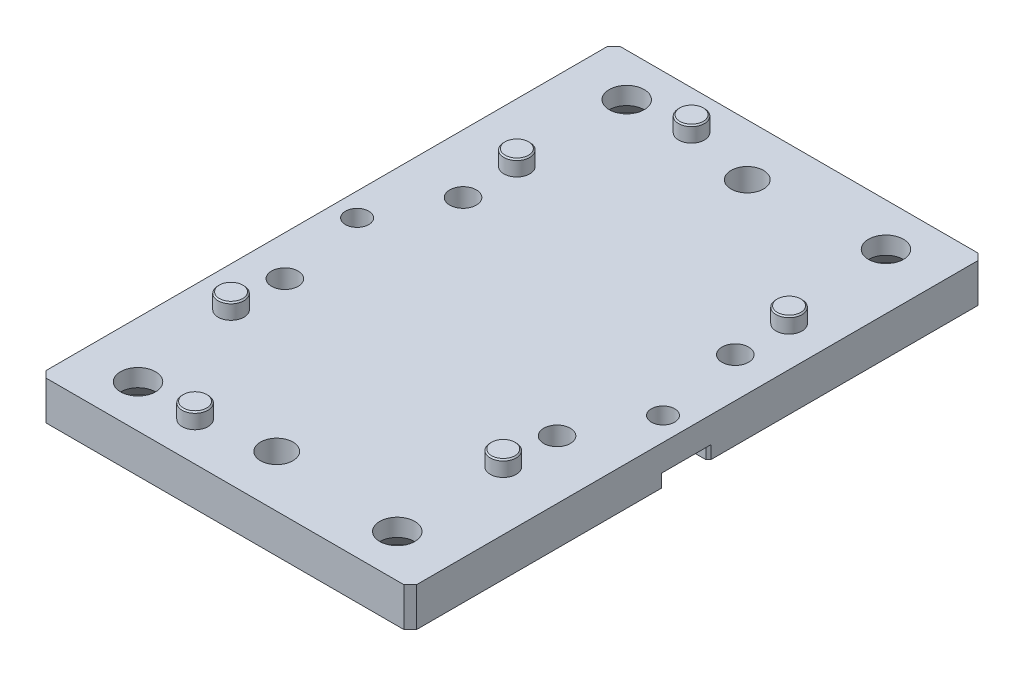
ISO-10303-21;
HEADER;
FILE_DESCRIPTION(('STEP AP214'),'2;1');
FILE_NAME('part.step','',(''),(''),'','','');
FILE_SCHEMA(('AUTOMOTIVE_DESIGN { 1 0 10303 214 1 1 1 1 }'));
ENDSEC;
DATA;
#1=APPLICATION_CONTEXT('core data for automotive mechanical design processes');
#2=APPLICATION_PROTOCOL_DEFINITION('international standard','automotive_design',2000,#1);
#3=PRODUCT_CONTEXT('',#1,'mechanical');
#4=PRODUCT('Part','Part','',(#3));
#5=PRODUCT_RELATED_PRODUCT_CATEGORY('part','',(#4));
#6=PRODUCT_DEFINITION_FORMATION('','',#4);
#7=PRODUCT_DEFINITION_CONTEXT('part definition',#1,'design');
#8=PRODUCT_DEFINITION('design','',#6,#7);
#9=PRODUCT_DEFINITION_SHAPE('','',#8);
#10=(LENGTH_UNIT() NAMED_UNIT(*) SI_UNIT(.MILLI.,.METRE.));
#11=(NAMED_UNIT(*) PLANE_ANGLE_UNIT() SI_UNIT($,.RADIAN.));
#12=(NAMED_UNIT(*) SI_UNIT($,.STERADIAN.) SOLID_ANGLE_UNIT());
#13=UNCERTAINTY_MEASURE_WITH_UNIT(LENGTH_MEASURE(1.E-05),#10,'distance_accuracy_value','');
#14=(GEOMETRIC_REPRESENTATION_CONTEXT(3) GLOBAL_UNCERTAINTY_ASSIGNED_CONTEXT((#13)) GLOBAL_UNIT_ASSIGNED_CONTEXT((#10,
#11,#12)) REPRESENTATION_CONTEXT('',''));
#15=CARTESIAN_POINT('',(0.,0.,0.));
#16=DIRECTION('',(0.,0.,1.));
#17=DIRECTION('',(1.,0.,0.));
#18=AXIS2_PLACEMENT_3D('',#15,#16,#17);
#19=CARTESIAN_POINT('',(10.8,-3.545823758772,12.85));
#20=DIRECTION('',(0.,-1.,0.));
#21=DIRECTION('',(0.,0.,-1.));
#22=AXIS2_PLACEMENT_3D('',#19,#20,#21);
#23=CYLINDRICAL_SURFACE('',#22,1.25);
#24=CARTESIAN_POINT('',(10.8,-10.65,12.85));
#25=DIRECTION('',(0.,-1.,0.));
#26=DIRECTION('',(0.,0.,-1.));
#27=AXIS2_PLACEMENT_3D('',#24,#25,#26);
#28=CIRCLE('',#27,1.25);
#29=CARTESIAN_POINT('',(10.8,-10.65,11.6));
#30=VERTEX_POINT('',#29);
#31=EDGE_CURVE('P0_E10',#30,#30,#28,.F.);
#32=ORIENTED_EDGE('',*,*,#31,.T.);
#33=EDGE_LOOP('',(#32));
#34=FACE_BOUND('',#33,.T.);
#35=CARTESIAN_POINT('',(10.8,-7.65,12.85));
#36=DIRECTION('',(0.,-1.,0.));
#37=DIRECTION('',(0.,0.,-1.));
#38=AXIS2_PLACEMENT_3D('',#35,#36,#37);
#39=CIRCLE('',#38,1.25);
#40=CARTESIAN_POINT('',(10.8,-7.65,11.6));
#41=VERTEX_POINT('',#40);
#42=EDGE_CURVE('P0_E16',#41,#41,#39,.T.);
#43=ORIENTED_EDGE('',*,*,#42,.T.);
#44=EDGE_LOOP('',(#43));
#45=FACE_BOUND('',#44,.T.);
#46=ADVANCED_FACE('P0_F15',(#34,#45),#23,.T.);
#47=OPEN_SHELL('',(#46));
#48=SHELL_BASED_SURFACE_MODEL('P0_B1',(#47));
#49=CARTESIAN_POINT('',(-11.65,-3.545823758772,25.15));
#50=DIRECTION('',(0.,-1.,0.));
#51=DIRECTION('',(0.,0.,-1.));
#52=AXIS2_PLACEMENT_3D('',#49,#50,#51);
#53=CYLINDRICAL_SURFACE('',#52,1.25);
#54=CARTESIAN_POINT('',(-11.65,-10.65,25.15));
#55=DIRECTION('',(0.,-1.,0.));
#56=DIRECTION('',(0.,0.,-1.));
#57=AXIS2_PLACEMENT_3D('',#54,#55,#56);
#58=CIRCLE('',#57,1.25);
#59=CARTESIAN_POINT('',(-11.65,-10.65,23.9));
#60=VERTEX_POINT('',#59);
#61=EDGE_CURVE('P1_E10',#60,#60,#58,.F.);
#62=ORIENTED_EDGE('',*,*,#61,.T.);
#63=EDGE_LOOP('',(#62));
#64=FACE_BOUND('',#63,.T.);
#65=CARTESIAN_POINT('',(-11.65,-7.65,25.15));
#66=DIRECTION('',(0.,-1.,0.));
#67=DIRECTION('',(0.,0.,-1.));
#68=AXIS2_PLACEMENT_3D('',#65,#66,#67);
#69=CIRCLE('',#68,1.25);
#70=CARTESIAN_POINT('',(-11.65,-7.65,23.9));
#71=VERTEX_POINT('',#70);
#72=EDGE_CURVE('P1_E16',#71,#71,#69,.T.);
#73=ORIENTED_EDGE('',*,*,#72,.T.);
#74=EDGE_LOOP('',(#73));
#75=FACE_BOUND('',#74,.T.);
#76=ADVANCED_FACE('P1_F15',(#64,#75),#53,.T.);
#77=OPEN_SHELL('',(#76));
#78=SHELL_BASED_SURFACE_MODEL('P1_B1',(#77));
#79=CARTESIAN_POINT('',(0.,-6.45,0.));
#80=DIRECTION('',(0.,-1.,0.));
#81=DIRECTION('',(0.,0.,-1.));
#82=AXIS2_PLACEMENT_3D('',#79,#80,#81);
#83=PLANE('',#82);
#84=CARTESIAN_POINT('',(10.8,-6.45000000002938,8.7));
#85=DIRECTION('',(0.,-1.,0.));
#86=DIRECTION('',(1.,0.,0.));
#87=AXIS2_PLACEMENT_3D('',#84,#85,#86);
#88=CIRCLE('',#87,0.900000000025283);
#89=CARTESIAN_POINT('',(11.7000000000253,-6.45000000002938,8.7));
#90=VERTEX_POINT('',#89);
#91=EDGE_CURVE('P2_E20',#90,#90,#88,.T.);
#92=ORIENTED_EDGE('',*,*,#91,.F.);
#93=EDGE_LOOP('',(#92));
#94=FACE_BOUND('',#93,.T.);
#95=ADVANCED_FACE('P2_F17',(#94),#83,.F.);
#96=CARTESIAN_POINT('',(0.,-6.45,0.));
#97=DIRECTION('',(0.,-1.,0.));
#98=DIRECTION('',(0.,0.,-1.));
#99=AXIS2_PLACEMENT_3D('',#96,#97,#98);
#100=PLANE('',#99);
#101=CARTESIAN_POINT('',(9.35,-6.44999999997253,29.3));
#102=DIRECTION('',(0.,-1.,0.));
#103=DIRECTION('',(0.,0.,-1.));
#104=AXIS2_PLACEMENT_3D('',#101,#102,#103);
#105=CIRCLE('',#104,0.899999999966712);
#106=CARTESIAN_POINT('',(9.35,-6.44999999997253,28.4000000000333));
#107=VERTEX_POINT('',#106);
#108=EDGE_CURVE('P2_E421',#107,#107,#105,.T.);
#109=ORIENTED_EDGE('',*,*,#108,.F.);
#110=EDGE_LOOP('',(#109));
#111=FACE_BOUND('',#110,.T.);
#112=ADVANCED_FACE('P2_F431',(#111),#100,.F.);
#113=CARTESIAN_POINT('',(0.,-6.45,0.));
#114=DIRECTION('',(0.,-1.,0.));
#115=DIRECTION('',(0.,0.,-1.));
#116=AXIS2_PLACEMENT_3D('',#113,#114,#115);
#117=PLANE('',#116);
#118=CARTESIAN_POINT('',(-11.65,-6.44999999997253,29.3));
#119=DIRECTION('',(0.,-1.,0.));
#120=DIRECTION('',(0.,0.,-1.));
#121=AXIS2_PLACEMENT_3D('',#118,#119,#120);
#122=CIRCLE('',#121,0.899999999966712);
#123=CARTESIAN_POINT('',(-11.65,-6.44999999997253,28.4000000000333));
#124=VERTEX_POINT('',#123);
#125=EDGE_CURVE('P2_E179',#124,#124,#122,.T.);
#126=ORIENTED_EDGE('',*,*,#125,.F.);
#127=EDGE_LOOP('',(#126));
#128=FACE_BOUND('',#127,.T.);
#129=ADVANCED_FACE('P2_F436',(#128),#117,.F.);
#130=CARTESIAN_POINT('',(0.,-6.45,0.));
#131=DIRECTION('',(0.,-1.,0.));
#132=DIRECTION('',(0.,0.,-1.));
#133=AXIS2_PLACEMENT_3D('',#130,#131,#132);
#134=PLANE('',#133);
#135=CARTESIAN_POINT('',(-10.2,-6.45000000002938,8.7));
#136=DIRECTION('',(0.,-1.,0.));
#137=DIRECTION('',(1.,0.,0.));
#138=AXIS2_PLACEMENT_3D('',#135,#136,#137);
#139=CIRCLE('',#138,0.900000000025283);
#140=CARTESIAN_POINT('',(-9.29999999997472,-6.45000000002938,8.7));
#141=VERTEX_POINT('',#140);
#142=EDGE_CURVE('P2_E176',#141,#141,#139,.T.);
#143=ORIENTED_EDGE('',*,*,#142,.F.);
#144=EDGE_LOOP('',(#143));
#145=FACE_BOUND('',#144,.T.);
#146=ADVANCED_FACE('P2_F643',(#145),#134,.F.);
#147=CARTESIAN_POINT('',(0.,-6.45,0.));
#148=DIRECTION('',(0.,-1.,0.));
#149=DIRECTION('',(0.,0.,-1.));
#150=AXIS2_PLACEMENT_3D('',#147,#148,#149);
#151=PLANE('',#150);
#152=CARTESIAN_POINT('',(-5.725,-6.44999999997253,38.));
#153=DIRECTION('',(0.,-1.,0.));
#154=DIRECTION('',(1.,0.,0.));
#155=AXIS2_PLACEMENT_3D('',#152,#153,#154);
#156=CIRCLE('',#155,0.89999999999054);
#157=CARTESIAN_POINT('',(-4.82500000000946,-6.44999999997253,38.));
#158=VERTEX_POINT('',#157);
#159=EDGE_CURVE('P2_E407',#158,#158,#156,.T.);
#160=ORIENTED_EDGE('',*,*,#159,.F.);
#161=EDGE_LOOP('',(#160));
#162=FACE_BOUND('',#161,.T.);
#163=ADVANCED_FACE('P2_F639',(#162),#151,.F.);
#164=CARTESIAN_POINT('',(0.,-6.45,0.));
#165=DIRECTION('',(0.,-1.,0.));
#166=DIRECTION('',(0.,0.,-1.));
#167=AXIS2_PLACEMENT_3D('',#164,#165,#166);
#168=PLANE('',#167);
#169=CARTESIAN_POINT('',(-5.725,-6.44999999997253,-0.3));
#170=DIRECTION('',(0.,-1.,0.));
#171=DIRECTION('',(0.,0.,-1.));
#172=AXIS2_PLACEMENT_3D('',#169,#170,#171);
#173=CIRCLE('',#172,0.899999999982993);
#174=CARTESIAN_POINT('',(-5.725,-6.44999999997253,-1.19999999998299));
#175=VERTEX_POINT('',#174);
#176=EDGE_CURVE('P2_E404',#175,#175,#173,.T.);
#177=ORIENTED_EDGE('',*,*,#176,.F.);
#178=EDGE_LOOP('',(#177));
#179=FACE_BOUND('',#178,.T.);
#180=ADVANCED_FACE('P2_F636',(#179),#168,.F.);
#181=CARTESIAN_POINT('',(-12.925,-10.65,18.3));
#182=DIRECTION('',(0.,-1.,0.));
#183=DIRECTION('',(0.,0.,-1.));
#184=AXIS2_PLACEMENT_3D('',#181,#182,#183);
#185=CYLINDRICAL_SURFACE('',#184,1.7);
#186=CARTESIAN_POINT('',(-12.925,-9.65,18.3));
#187=DIRECTION('',(0.,-1.,0.));
#188=DIRECTION('',(0.,0.,-1.));
#189=AXIS2_PLACEMENT_3D('',#186,#187,#188);
#190=CIRCLE('',#189,1.7);
#191=CARTESIAN_POINT('',(-12.925,-9.65,16.6));
#192=VERTEX_POINT('',#191);
#193=CARTESIAN_POINT('',(-12.925,-9.65,20.));
#194=VERTEX_POINT('',#193);
#195=EDGE_CURVE('P2_E399',#192,#194,#190,.T.);
#196=ORIENTED_EDGE('',*,*,#195,.F.);
#197=DIRECTION('',(0.,1.,0.));
#198=VECTOR('',#197,1.);
#199=CARTESIAN_POINT('',(-12.925,-10.65,16.6));
#200=LINE('',#199,#198);
#201=CARTESIAN_POINT('',(-12.925,-10.65,16.6));
#202=VERTEX_POINT('',#201);
#203=EDGE_CURVE('P2_E160',#192,#202,#200,.F.);
#204=ORIENTED_EDGE('',*,*,#203,.T.);
#205=CARTESIAN_POINT('',(-12.925,-10.65,18.3));
#206=DIRECTION('',(0.,-1.,0.));
#207=DIRECTION('',(0.,0.,-1.));
#208=AXIS2_PLACEMENT_3D('',#205,#206,#207);
#209=CIRCLE('',#208,1.7);
#210=CARTESIAN_POINT('',(-12.925,-10.65,20.));
#211=VERTEX_POINT('',#210);
#212=EDGE_CURVE('P2_E151',#211,#202,#209,.F.);
#213=ORIENTED_EDGE('',*,*,#212,.F.);
#214=DIRECTION('',(0.,1.,0.));
#215=VECTOR('',#214,1.);
#216=CARTESIAN_POINT('',(-12.925,-10.65,20.));
#217=LINE('',#216,#215);
#218=EDGE_CURVE('P2_E157',#211,#194,#217,.T.);
#219=ORIENTED_EDGE('',*,*,#218,.T.);
#220=EDGE_LOOP('',(#196,#204,#213,#219));
#221=FACE_BOUND('',#220,.T.);
#222=ADVANCED_FACE('P2_F156',(#221),#185,.F.);
#223=CARTESIAN_POINT('',(-12.925,-10.65,20.));
#224=DIRECTION('',(0.,0.,1.));
#225=DIRECTION('',(1.,0.,0.));
#226=AXIS2_PLACEMENT_3D('',#223,#224,#225);
#227=PLANE('',#226);
#228=ORIENTED_EDGE('',*,*,#218,.F.);
#229=DIRECTION('',(1.,0.,0.));
#230=VECTOR('',#229,1.);
#231=CARTESIAN_POINT('',(0.,-10.65,20.));
#232=LINE('',#231,#230);
#233=CARTESIAN_POINT('',(-14.525,-10.65,20.));
#234=VERTEX_POINT('',#233);
#235=EDGE_CURVE('P2_E163',#234,#211,#232,.T.);
#236=ORIENTED_EDGE('',*,*,#235,.F.);
#237=DIRECTION('',(0.,1.,0.));
#238=VECTOR('',#237,1.);
#239=CARTESIAN_POINT('',(-14.525,-10.15,20.));
#240=LINE('',#239,#238);
#241=CARTESIAN_POINT('',(-14.525,-9.65,20.));
#242=VERTEX_POINT('',#241);
#243=EDGE_CURVE('P2_E216',#242,#234,#240,.F.);
#244=ORIENTED_EDGE('',*,*,#243,.F.);
#245=DIRECTION('',(1.,0.,0.));
#246=VECTOR('',#245,1.);
#247=CARTESIAN_POINT('',(0.,-9.65,20.));
#248=LINE('',#247,#246);
#249=EDGE_CURVE('P2_E169',#194,#242,#248,.F.);
#250=ORIENTED_EDGE('',*,*,#249,.F.);
#251=EDGE_LOOP('',(#228,#236,#244,#250));
#252=FACE_BOUND('',#251,.T.);
#253=ADVANCED_FACE('P2_F167',(#252),#227,.F.);
#254=CARTESIAN_POINT('',(-14.725,-10.65,16.6));
#255=DIRECTION('',(0.,0.,-1.));
#256=DIRECTION('',(-1.,0.,0.));
#257=AXIS2_PLACEMENT_3D('',#254,#255,#256);
#258=PLANE('',#257);
#259=ORIENTED_EDGE('',*,*,#203,.F.);
#260=DIRECTION('',(1.,0.,0.));
#261=VECTOR('',#260,1.);
#262=CARTESIAN_POINT('',(0.,-9.65,16.6));
#263=LINE('',#262,#261);
#264=CARTESIAN_POINT('',(-14.525,-9.65,16.6));
#265=VERTEX_POINT('',#264);
#266=EDGE_CURVE('P2_E262',#265,#192,#263,.T.);
#267=ORIENTED_EDGE('',*,*,#266,.F.);
#268=DIRECTION('',(0.,1.,0.));
#269=VECTOR('',#268,1.);
#270=CARTESIAN_POINT('',(-14.525,-10.15,16.6));
#271=LINE('',#270,#269);
#272=CARTESIAN_POINT('',(-14.525,-10.65,16.6));
#273=VERTEX_POINT('',#272);
#274=EDGE_CURVE('P2_E213',#273,#265,#271,.T.);
#275=ORIENTED_EDGE('',*,*,#274,.F.);
#276=DIRECTION('',(1.,0.,0.));
#277=VECTOR('',#276,1.);
#278=CARTESIAN_POINT('',(0.,-10.65,16.6));
#279=LINE('',#278,#277);
#280=EDGE_CURVE('P2_E162',#202,#273,#279,.F.);
#281=ORIENTED_EDGE('',*,*,#280,.F.);
#282=EDGE_LOOP('',(#259,#267,#275,#281));
#283=FACE_BOUND('',#282,.T.);
#284=ADVANCED_FACE('P2_F627',(#283),#258,.F.);
#285=CARTESIAN_POINT('',(12.075,-10.65,19.7));
#286=DIRECTION('',(0.,-1.,0.));
#287=DIRECTION('',(0.,0.,-1.));
#288=AXIS2_PLACEMENT_3D('',#285,#286,#287);
#289=CYLINDRICAL_SURFACE('',#288,1.7);
#290=CARTESIAN_POINT('',(12.075,-9.65,19.7));
#291=DIRECTION('',(0.,-1.,0.));
#292=DIRECTION('',(0.,0.,-1.));
#293=AXIS2_PLACEMENT_3D('',#290,#291,#292);
#294=CIRCLE('',#293,1.7);
#295=CARTESIAN_POINT('',(12.075,-9.65,21.4));
#296=VERTEX_POINT('',#295);
#297=CARTESIAN_POINT('',(12.075,-9.65,18.));
#298=VERTEX_POINT('',#297);
#299=EDGE_CURVE('P2_E397',#296,#298,#294,.T.);
#300=ORIENTED_EDGE('',*,*,#299,.F.);
#301=DIRECTION('',(0.,1.,0.));
#302=VECTOR('',#301,1.);
#303=CARTESIAN_POINT('',(12.075,-10.65,21.4));
#304=LINE('',#303,#302);
#305=CARTESIAN_POINT('',(12.075,-10.65,21.4));
#306=VERTEX_POINT('',#305);
#307=EDGE_CURVE('P2_E221',#296,#306,#304,.F.);
#308=ORIENTED_EDGE('',*,*,#307,.T.);
#309=CARTESIAN_POINT('',(12.075,-10.65,19.7));
#310=DIRECTION('',(0.,-1.,0.));
#311=DIRECTION('',(0.,0.,-1.));
#312=AXIS2_PLACEMENT_3D('',#309,#310,#311);
#313=CIRCLE('',#312,1.7);
#314=CARTESIAN_POINT('',(12.075,-10.65,18.));
#315=VERTEX_POINT('',#314);
#316=EDGE_CURVE('P2_E418',#315,#306,#313,.F.);
#317=ORIENTED_EDGE('',*,*,#316,.F.);
#318=DIRECTION('',(0.,1.,0.));
#319=VECTOR('',#318,1.);
#320=CARTESIAN_POINT('',(12.075,-10.65,18.));
#321=LINE('',#320,#319);
#322=EDGE_CURVE('P2_E224',#315,#298,#321,.T.);
#323=ORIENTED_EDGE('',*,*,#322,.T.);
#324=EDGE_LOOP('',(#300,#308,#317,#323));
#325=FACE_BOUND('',#324,.T.);
#326=ADVANCED_FACE('P2_F623',(#325),#289,.F.);
#327=CARTESIAN_POINT('',(12.075,-10.65,18.));
#328=DIRECTION('',(0.,0.,-1.));
#329=DIRECTION('',(-1.,0.,0.));
#330=AXIS2_PLACEMENT_3D('',#327,#328,#329);
#331=PLANE('',#330);
#332=ORIENTED_EDGE('',*,*,#322,.F.);
#333=DIRECTION('',(1.,0.,0.));
#334=VECTOR('',#333,1.);
#335=CARTESIAN_POINT('',(0.,-10.65,18.));
#336=LINE('',#335,#334);
#337=CARTESIAN_POINT('',(13.675,-10.65,18.));
#338=VERTEX_POINT('',#337);
#339=EDGE_CURVE('P2_E296',#338,#315,#336,.F.);
#340=ORIENTED_EDGE('',*,*,#339,.F.);
#341=DIRECTION('',(0.,1.,0.));
#342=VECTOR('',#341,1.);
#343=CARTESIAN_POINT('',(13.675,-10.15,18.));
#344=LINE('',#343,#342);
#345=CARTESIAN_POINT('',(13.675,-9.65,18.));
#346=VERTEX_POINT('',#345);
#347=EDGE_CURVE('P2_E217',#346,#338,#344,.F.);
#348=ORIENTED_EDGE('',*,*,#347,.F.);
#349=DIRECTION('',(1.,0.,0.));
#350=VECTOR('',#349,1.);
#351=CARTESIAN_POINT('',(0.,-9.65,18.));
#352=LINE('',#351,#350);
#353=EDGE_CURVE('P2_E255',#298,#346,#352,.T.);
#354=ORIENTED_EDGE('',*,*,#353,.F.);
#355=EDGE_LOOP('',(#332,#340,#348,#354));
#356=FACE_BOUND('',#355,.T.);
#357=ADVANCED_FACE('P2_F619',(#356),#331,.F.);
#358=CARTESIAN_POINT('',(13.875,-10.65,21.4));
#359=DIRECTION('',(0.,0.,1.));
#360=DIRECTION('',(1.,0.,0.));
#361=AXIS2_PLACEMENT_3D('',#358,#359,#360);
#362=PLANE('',#361);
#363=ORIENTED_EDGE('',*,*,#307,.F.);
#364=DIRECTION('',(1.,0.,0.));
#365=VECTOR('',#364,1.);
#366=CARTESIAN_POINT('',(0.,-9.65,21.4));
#367=LINE('',#366,#365);
#368=CARTESIAN_POINT('',(13.675,-9.65,21.4));
#369=VERTEX_POINT('',#368);
#370=EDGE_CURVE('P2_E228',#369,#296,#367,.F.);
#371=ORIENTED_EDGE('',*,*,#370,.F.);
#372=DIRECTION('',(0.,1.,0.));
#373=VECTOR('',#372,1.);
#374=CARTESIAN_POINT('',(13.675,-10.15,21.4));
#375=LINE('',#374,#373);
#376=CARTESIAN_POINT('',(13.675,-10.65,21.4));
#377=VERTEX_POINT('',#376);
#378=EDGE_CURVE('P2_E220',#377,#369,#375,.T.);
#379=ORIENTED_EDGE('',*,*,#378,.F.);
#380=DIRECTION('',(1.,0.,0.));
#381=VECTOR('',#380,1.);
#382=CARTESIAN_POINT('',(0.,-10.65,21.4));
#383=LINE('',#382,#381);
#384=EDGE_CURVE('P2_E290',#306,#377,#383,.T.);
#385=ORIENTED_EDGE('',*,*,#384,.F.);
#386=EDGE_LOOP('',(#363,#371,#379,#385));
#387=FACE_BOUND('',#386,.T.);
#388=ADVANCED_FACE('P2_F615',(#387),#362,.F.);
#389=CARTESIAN_POINT('',(13.775,-10.15,21.5));
#390=DIRECTION('',(0.707106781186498,0.,-0.707106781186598));
#391=DIRECTION('',(-0.707106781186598,0.,-0.707106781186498));
#392=AXIS2_PLACEMENT_3D('',#389,#390,#391);
#393=PLANE('',#392);
#394=DIRECTION('',(0.707106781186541,0.,0.707106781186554));
#395=VECTOR('',#394,1.);
#396=CARTESIAN_POINT('',(13.675,-10.65,21.4));
#397=LINE('',#396,#395);
#398=CARTESIAN_POINT('',(13.875,-10.65,21.6));
#399=VERTEX_POINT('',#398);
#400=EDGE_CURVE('P2_E287',#377,#399,#397,.T.);
#401=ORIENTED_EDGE('',*,*,#400,.F.);
#402=ORIENTED_EDGE('',*,*,#378,.T.);
#403=DIRECTION('',(-0.707106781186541,0.,-0.707106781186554));
#404=VECTOR('',#403,1.);
#405=CARTESIAN_POINT('',(13.875,-9.65,21.6));
#406=LINE('',#405,#404);
#407=CARTESIAN_POINT('',(13.875,-9.65,21.6));
#408=VERTEX_POINT('',#407);
#409=EDGE_CURVE('P2_E225',#408,#369,#406,.T.);
#410=ORIENTED_EDGE('',*,*,#409,.F.);
#411=DIRECTION('',(0.,1.,0.));
#412=VECTOR('',#411,1.);
#413=CARTESIAN_POINT('',(13.875,-10.65,21.6));
#414=LINE('',#413,#412);
#415=EDGE_CURVE('P2_E235',#408,#399,#414,.F.);
#416=ORIENTED_EDGE('',*,*,#415,.T.);
#417=EDGE_LOOP('',(#401,#402,#410,#416));
#418=FACE_BOUND('',#417,.T.);
#419=ADVANCED_FACE('P2_F611',(#418),#393,.T.);
#420=CARTESIAN_POINT('',(13.625,-9.15,-3.05));
#421=DIRECTION('',(0.707106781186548,0.,-0.707106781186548));
#422=DIRECTION('',(-0.707106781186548,0.,-0.707106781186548));
#423=AXIS2_PLACEMENT_3D('',#420,#421,#422);
#424=PLANE('',#423);
#425=DIRECTION('',(0.,1.,0.));
#426=VECTOR('',#425,1.);
#427=CARTESIAN_POINT('',(13.875,-10.65,-2.8));
#428=LINE('',#427,#426);
#429=CARTESIAN_POINT('',(13.875,-7.65,-2.8));
#430=VERTEX_POINT('',#429);
#431=CARTESIAN_POINT('',(13.875,-10.65,-2.8));
#432=VERTEX_POINT('',#431);
#433=EDGE_CURVE('P2_E307',#430,#432,#428,.F.);
#434=ORIENTED_EDGE('',*,*,#433,.T.);
#435=DIRECTION('',(0.707106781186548,0.,0.707106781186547));
#436=VECTOR('',#435,1.);
#437=CARTESIAN_POINT('',(13.375,-10.65,-3.3));
#438=LINE('',#437,#436);
#439=CARTESIAN_POINT('',(13.375,-10.65,-3.3));
#440=VERTEX_POINT('',#439);
#441=EDGE_CURVE('P2_E297',#440,#432,#438,.T.);
#442=ORIENTED_EDGE('',*,*,#441,.F.);
#443=DIRECTION('',(0.,1.,0.));
#444=VECTOR('',#443,1.);
#445=CARTESIAN_POINT('',(13.375,-7.65,-3.3));
#446=LINE('',#445,#444);
#447=CARTESIAN_POINT('',(13.375,-7.65,-3.3));
#448=VERTEX_POINT('',#447);
#449=EDGE_CURVE('P2_E1061',#448,#440,#446,.F.);
#450=ORIENTED_EDGE('',*,*,#449,.F.);
#451=DIRECTION('',(-0.707106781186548,0.,-0.707106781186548));
#452=VECTOR('',#451,1.);
#453=CARTESIAN_POINT('',(13.625,-7.65,-3.05));
#454=LINE('',#453,#452);
#455=EDGE_CURVE('P2_E218',#448,#430,#454,.F.);
#456=ORIENTED_EDGE('',*,*,#455,.T.);
#457=EDGE_LOOP('',(#434,#442,#450,#456));
#458=FACE_BOUND('',#457,.T.);
#459=ADVANCED_FACE('P2_F607',(#458),#424,.T.);
#460=CARTESIAN_POINT('',(13.775,-10.15,17.9));
#461=DIRECTION('',(0.707106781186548,0.,0.707106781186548));
#462=DIRECTION('',(0.707106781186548,0.,-0.707106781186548));
#463=AXIS2_PLACEMENT_3D('',#460,#461,#462);
#464=PLANE('',#463);
#465=ORIENTED_EDGE('',*,*,#347,.T.);
#466=DIRECTION('',(-0.707106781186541,0.,0.707106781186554));
#467=VECTOR('',#466,1.);
#468=CARTESIAN_POINT('',(13.875,-10.65,17.8));
#469=LINE('',#468,#467);
#470=CARTESIAN_POINT('',(13.875,-10.65,17.8));
#471=VERTEX_POINT('',#470);
#472=EDGE_CURVE('P2_E293',#471,#338,#469,.T.);
#473=ORIENTED_EDGE('',*,*,#472,.F.);
#474=DIRECTION('',(0.,1.,0.));
#475=VECTOR('',#474,1.);
#476=CARTESIAN_POINT('',(13.875,-10.65,17.8));
#477=LINE('',#476,#475);
#478=CARTESIAN_POINT('',(13.875,-9.65,17.8));
#479=VERTEX_POINT('',#478);
#480=EDGE_CURVE('P2_E246',#471,#479,#477,.T.);
#481=ORIENTED_EDGE('',*,*,#480,.T.);
#482=DIRECTION('',(0.707106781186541,0.,-0.707106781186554));
#483=VECTOR('',#482,1.);
#484=CARTESIAN_POINT('',(13.675,-9.65,18.));
#485=LINE('',#484,#483);
#486=EDGE_CURVE('P2_E229',#346,#479,#485,.T.);
#487=ORIENTED_EDGE('',*,*,#486,.F.);
#488=EDGE_LOOP('',(#465,#473,#481,#487));
#489=FACE_BOUND('',#488,.T.);
#490=ADVANCED_FACE('P2_F603',(#489),#464,.T.);
#491=CARTESIAN_POINT('',(13.625,-9.15,40.75));
#492=DIRECTION('',(0.707106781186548,0.,0.707106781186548));
#493=DIRECTION('',(0.707106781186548,0.,-0.707106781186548));
#494=AXIS2_PLACEMENT_3D('',#491,#492,#493);
#495=PLANE('',#494);
#496=DIRECTION('',(0.,1.,0.));
#497=VECTOR('',#496,1.);
#498=CARTESIAN_POINT('',(13.875,-10.65,40.5));
#499=LINE('',#498,#497);
#500=CARTESIAN_POINT('',(13.875,-10.65,40.5));
#501=VERTEX_POINT('',#500);
#502=CARTESIAN_POINT('',(13.875,-7.65,40.5));
#503=VERTEX_POINT('',#502);
#504=EDGE_CURVE('P2_E1051',#501,#503,#499,.T.);
#505=ORIENTED_EDGE('',*,*,#504,.T.);
#506=DIRECTION('',(0.707106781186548,0.,-0.707106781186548));
#507=VECTOR('',#506,1.);
#508=CARTESIAN_POINT('',(13.625,-7.65,40.75));
#509=LINE('',#508,#507);
#510=CARTESIAN_POINT('',(13.375,-7.65,41.));
#511=VERTEX_POINT('',#510);
#512=EDGE_CURVE('P2_E214',#503,#511,#509,.F.);
#513=ORIENTED_EDGE('',*,*,#512,.T.);
#514=DIRECTION('',(0.,1.,0.));
#515=VECTOR('',#514,1.);
#516=CARTESIAN_POINT('',(13.375,-7.65,41.));
#517=LINE('',#516,#515);
#518=CARTESIAN_POINT('',(13.375,-10.65,41.));
#519=VERTEX_POINT('',#518);
#520=EDGE_CURVE('P2_E1040',#519,#511,#517,.T.);
#521=ORIENTED_EDGE('',*,*,#520,.F.);
#522=DIRECTION('',(-0.707106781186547,0.,0.707106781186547));
#523=VECTOR('',#522,1.);
#524=CARTESIAN_POINT('',(13.875,-10.65,40.5));
#525=LINE('',#524,#523);
#526=EDGE_CURVE('P2_E289',#501,#519,#525,.T.);
#527=ORIENTED_EDGE('',*,*,#526,.F.);
#528=EDGE_LOOP('',(#505,#513,#521,#527));
#529=FACE_BOUND('',#528,.T.);
#530=ADVANCED_FACE('P2_F599',(#529),#495,.T.);
#531=CARTESIAN_POINT('',(-14.625,-10.15,20.1));
#532=DIRECTION('',(-0.707106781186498,0.,-0.707106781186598));
#533=DIRECTION('',(-0.707106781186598,0.,0.707106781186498));
#534=AXIS2_PLACEMENT_3D('',#531,#532,#533);
#535=PLANE('',#534);
#536=ORIENTED_EDGE('',*,*,#243,.T.);
#537=DIRECTION('',(0.707106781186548,0.,-0.707106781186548));
#538=VECTOR('',#537,1.);
#539=CARTESIAN_POINT('',(-14.725,-10.65,20.2));
#540=LINE('',#539,#538);
#541=CARTESIAN_POINT('',(-14.725,-10.65,20.2));
#542=VERTEX_POINT('',#541);
#543=EDGE_CURVE('P2_E175',#542,#234,#540,.T.);
#544=ORIENTED_EDGE('',*,*,#543,.F.);
#545=DIRECTION('',(0.,1.,0.));
#546=VECTOR('',#545,1.);
#547=CARTESIAN_POINT('',(-14.725,-10.65,20.2));
#548=LINE('',#547,#546);
#549=CARTESIAN_POINT('',(-14.725,-9.65,20.2));
#550=VERTEX_POINT('',#549);
#551=EDGE_CURVE('P2_E278',#542,#550,#548,.T.);
#552=ORIENTED_EDGE('',*,*,#551,.T.);
#553=DIRECTION('',(-0.707106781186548,0.,0.707106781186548));
#554=VECTOR('',#553,1.);
#555=CARTESIAN_POINT('',(-14.525,-9.65,20.));
#556=LINE('',#555,#554);
#557=EDGE_CURVE('P2_E263',#242,#550,#556,.T.);
#558=ORIENTED_EDGE('',*,*,#557,.F.);
#559=EDGE_LOOP('',(#536,#544,#552,#558));
#560=FACE_BOUND('',#559,.T.);
#561=ADVANCED_FACE('P2_F595',(#560),#535,.T.);
#562=CARTESIAN_POINT('',(-14.625,-10.15,16.5));
#563=DIRECTION('',(-0.707106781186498,0.,0.707106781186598));
#564=DIRECTION('',(0.707106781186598,0.,0.707106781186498));
#565=AXIS2_PLACEMENT_3D('',#562,#563,#564);
#566=PLANE('',#565);
#567=DIRECTION('',(-0.707106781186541,0.,-0.707106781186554));
#568=VECTOR('',#567,1.);
#569=CARTESIAN_POINT('',(-14.525,-10.65,16.6));
#570=LINE('',#569,#568);
#571=CARTESIAN_POINT('',(-14.725,-10.65,16.4));
#572=VERTEX_POINT('',#571);
#573=EDGE_CURVE('P2_E310',#273,#572,#570,.T.);
#574=ORIENTED_EDGE('',*,*,#573,.F.);
#575=ORIENTED_EDGE('',*,*,#274,.T.);
#576=DIRECTION('',(0.707106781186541,0.,0.707106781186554));
#577=VECTOR('',#576,1.);
#578=CARTESIAN_POINT('',(-14.725,-9.65,16.4));
#579=LINE('',#578,#577);
#580=CARTESIAN_POINT('',(-14.725,-9.65,16.4));
#581=VERTEX_POINT('',#580);
#582=EDGE_CURVE('P2_E259',#581,#265,#579,.T.);
#583=ORIENTED_EDGE('',*,*,#582,.F.);
#584=DIRECTION('',(0.,1.,0.));
#585=VECTOR('',#584,1.);
#586=CARTESIAN_POINT('',(-14.725,-10.65,16.4));
#587=LINE('',#586,#585);
#588=EDGE_CURVE('P2_E269',#581,#572,#587,.F.);
#589=ORIENTED_EDGE('',*,*,#588,.T.);
#590=EDGE_LOOP('',(#574,#575,#583,#589));
#591=FACE_BOUND('',#590,.T.);
#592=ADVANCED_FACE('P2_F591',(#591),#566,.T.);
#593=CARTESIAN_POINT('',(-14.475,-9.15,-3.05));
#594=DIRECTION('',(-0.707106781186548,0.,-0.707106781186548));
#595=DIRECTION('',(-0.707106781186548,0.,0.707106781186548));
#596=AXIS2_PLACEMENT_3D('',#593,#594,#595);
#597=PLANE('',#596);
#598=DIRECTION('',(0.,1.,0.));
#599=VECTOR('',#598,1.);
#600=CARTESIAN_POINT('',(-14.725,-10.65,-2.8));
#601=LINE('',#600,#599);
#602=CARTESIAN_POINT('',(-14.725,-10.65,-2.8));
#603=VERTEX_POINT('',#602);
#604=CARTESIAN_POINT('',(-14.725,-7.65,-2.8));
#605=VERTEX_POINT('',#604);
#606=EDGE_CURVE('P2_E1096',#603,#605,#601,.T.);
#607=ORIENTED_EDGE('',*,*,#606,.T.);
#608=DIRECTION('',(-0.707106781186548,0.,0.707106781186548));
#609=VECTOR('',#608,1.);
#610=CARTESIAN_POINT('',(-14.475,-7.65,-3.05));
#611=LINE('',#610,#609);
#612=CARTESIAN_POINT('',(-14.225,-7.65,-3.3));
#613=VERTEX_POINT('',#612);
#614=EDGE_CURVE('P2_E211',#605,#613,#611,.F.);
#615=ORIENTED_EDGE('',*,*,#614,.T.);
#616=DIRECTION('',(0.,1.,0.));
#617=VECTOR('',#616,1.);
#618=CARTESIAN_POINT('',(-14.225,-7.65,-3.3));
#619=LINE('',#618,#617);
#620=CARTESIAN_POINT('',(-14.225,-10.65,-3.3));
#621=VERTEX_POINT('',#620);
#622=EDGE_CURVE('P2_E239',#621,#613,#619,.T.);
#623=ORIENTED_EDGE('',*,*,#622,.F.);
#624=DIRECTION('',(0.707106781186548,0.,-0.707106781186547));
#625=VECTOR('',#624,1.);
#626=CARTESIAN_POINT('',(-14.725,-10.65,-2.8));
#627=LINE('',#626,#625);
#628=EDGE_CURVE('P2_E312',#603,#621,#627,.T.);
#629=ORIENTED_EDGE('',*,*,#628,.F.);
#630=EDGE_LOOP('',(#607,#615,#623,#629));
#631=FACE_BOUND('',#630,.T.);
#632=ADVANCED_FACE('P2_F588',(#631),#597,.T.);
#633=CARTESIAN_POINT('',(-14.475,-9.15,40.75));
#634=DIRECTION('',(-0.707106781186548,0.,0.707106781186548));
#635=DIRECTION('',(0.707106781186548,0.,0.707106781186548));
#636=AXIS2_PLACEMENT_3D('',#633,#634,#635);
#637=PLANE('',#636);
#638=DIRECTION('',(0.,1.,0.));
#639=VECTOR('',#638,1.);
#640=CARTESIAN_POINT('',(-14.725,-10.65,40.5));
#641=LINE('',#640,#639);
#642=CARTESIAN_POINT('',(-14.725,-7.65,40.5));
#643=VERTEX_POINT('',#642);
#644=CARTESIAN_POINT('',(-14.725,-10.65,40.5));
#645=VERTEX_POINT('',#644);
#646=EDGE_CURVE('P2_E1095',#643,#645,#641,.F.);
#647=ORIENTED_EDGE('',*,*,#646,.T.);
#648=DIRECTION('',(-0.707106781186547,0.,-0.707106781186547));
#649=VECTOR('',#648,1.);
#650=CARTESIAN_POINT('',(-14.225,-10.65,41.));
#651=LINE('',#650,#649);
#652=CARTESIAN_POINT('',(-14.225,-10.65,41.));
#653=VERTEX_POINT('',#652);
#654=EDGE_CURVE('P2_E317',#653,#645,#651,.T.);
#655=ORIENTED_EDGE('',*,*,#654,.F.);
#656=DIRECTION('',(0.,1.,0.));
#657=VECTOR('',#656,1.);
#658=CARTESIAN_POINT('',(-14.225,-7.65,41.));
#659=LINE('',#658,#657);
#660=CARTESIAN_POINT('',(-14.225,-7.65,41.));
#661=VERTEX_POINT('',#660);
#662=EDGE_CURVE('P2_E1037',#661,#653,#659,.F.);
#663=ORIENTED_EDGE('',*,*,#662,.F.);
#664=DIRECTION('',(0.707106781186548,0.,0.707106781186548));
#665=VECTOR('',#664,1.);
#666=CARTESIAN_POINT('',(-14.475,-7.65,40.75));
#667=LINE('',#666,#665);
#668=EDGE_CURVE('P2_E35',#661,#643,#667,.F.);
#669=ORIENTED_EDGE('',*,*,#668,.T.);
#670=EDGE_LOOP('',(#647,#655,#663,#669));
#671=FACE_BOUND('',#670,.T.);
#672=ADVANCED_FACE('P2_F584',(#671),#637,.T.);
#673=CARTESIAN_POINT('',(-10.425,-10.6499999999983,37.7));
#674=DIRECTION('',(0.,-1.,0.));
#675=DIRECTION('',(0.,0.,-1.));
#676=AXIS2_PLACEMENT_3D('',#673,#674,#675);
#677=CONICAL_SURFACE('',#676,2.99999999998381,0.785398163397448);
#678=CARTESIAN_POINT('',(-10.425,-9.,37.7));
#679=DIRECTION('',(0.,-1.,0.));
#680=DIRECTION('',(0.,0.,-1.));
#681=AXIS2_PLACEMENT_3D('',#678,#679,#680);
#682=CIRCLE('',#681,1.35);
#683=CARTESIAN_POINT('',(-10.425,-9.,36.35));
#684=VERTEX_POINT('',#683);
#685=EDGE_CURVE('P2_E206',#684,#684,#682,.F.);
#686=ORIENTED_EDGE('',*,*,#685,.T.);
#687=EDGE_LOOP('',(#686));
#688=FACE_BOUND('',#687,.T.);
#689=CARTESIAN_POINT('',(-10.425,-10.6499999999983,37.7));
#690=DIRECTION('',(0.,-1.,0.));
#691=DIRECTION('',(0.,0.,-1.));
#692=AXIS2_PLACEMENT_3D('',#689,#690,#691);
#693=CIRCLE('',#692,2.99999999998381);
#694=CARTESIAN_POINT('',(-10.425,-10.6499999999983,34.7000000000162));
#695=VERTEX_POINT('',#694);
#696=EDGE_CURVE('P2_E316',#695,#695,#693,.F.);
#697=ORIENTED_EDGE('',*,*,#696,.F.);
#698=EDGE_LOOP('',(#697));
#699=FACE_BOUND('',#698,.T.);
#700=ADVANCED_FACE('P2_F580',(#688,#699),#677,.F.);
#701=CARTESIAN_POINT('',(9.575,-10.6499999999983,0.));
#702=DIRECTION('',(0.,-1.,0.));
#703=DIRECTION('',(0.,0.,-1.));
#704=AXIS2_PLACEMENT_3D('',#701,#702,#703);
#705=CONICAL_SURFACE('',#704,3.000000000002,0.785398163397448);
#706=CARTESIAN_POINT('',(9.575,-9.,0.));
#707=DIRECTION('',(0.,-1.,0.));
#708=DIRECTION('',(0.,0.,-1.));
#709=AXIS2_PLACEMENT_3D('',#706,#707,#708);
#710=CIRCLE('',#709,1.35);
#711=CARTESIAN_POINT('',(9.575,-9.,-1.35));
#712=VERTEX_POINT('',#711);
#713=EDGE_CURVE('P2_E203',#712,#712,#710,.F.);
#714=ORIENTED_EDGE('',*,*,#713,.T.);
#715=EDGE_LOOP('',(#714));
#716=FACE_BOUND('',#715,.T.);
#717=CARTESIAN_POINT('',(9.575,-10.6499999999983,0.));
#718=DIRECTION('',(0.,-1.,0.));
#719=DIRECTION('',(0.,0.,-1.));
#720=AXIS2_PLACEMENT_3D('',#717,#718,#719);
#721=CIRCLE('',#720,3.000000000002);
#722=CARTESIAN_POINT('',(9.575,-10.6499999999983,-3.000000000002));
#723=VERTEX_POINT('',#722);
#724=EDGE_CURVE('P2_E413',#723,#723,#721,.F.);
#725=ORIENTED_EDGE('',*,*,#724,.F.);
#726=EDGE_LOOP('',(#725));
#727=FACE_BOUND('',#726,.T.);
#728=ADVANCED_FACE('P2_F576',(#716,#727),#705,.F.);
#729=CARTESIAN_POINT('',(-10.425,-10.6499999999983,0.));
#730=DIRECTION('',(0.,-1.,0.));
#731=DIRECTION('',(0.,0.,-1.));
#732=AXIS2_PLACEMENT_3D('',#729,#730,#731);
#733=CONICAL_SURFACE('',#732,2.99999999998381,0.785398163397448);
#734=CARTESIAN_POINT('',(-10.425,-9.,0.));
#735=DIRECTION('',(0.,-1.,0.));
#736=DIRECTION('',(0.,0.,-1.));
#737=AXIS2_PLACEMENT_3D('',#734,#735,#736);
#738=CIRCLE('',#737,1.35);
#739=CARTESIAN_POINT('',(-10.425,-9.,-1.35));
#740=VERTEX_POINT('',#739);
#741=EDGE_CURVE('P2_E200',#740,#740,#738,.F.);
#742=ORIENTED_EDGE('',*,*,#741,.T.);
#743=EDGE_LOOP('',(#742));
#744=FACE_BOUND('',#743,.T.);
#745=CARTESIAN_POINT('',(-10.425,-10.6499999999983,0.));
#746=DIRECTION('',(0.,-1.,0.));
#747=DIRECTION('',(0.,0.,-1.));
#748=AXIS2_PLACEMENT_3D('',#745,#746,#747);
#749=CIRCLE('',#748,2.99999999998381);
#750=CARTESIAN_POINT('',(-10.425,-10.6499999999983,-2.99999999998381));
#751=VERTEX_POINT('',#750);
#752=EDGE_CURVE('P2_E410',#751,#751,#749,.F.);
#753=ORIENTED_EDGE('',*,*,#752,.F.);
#754=EDGE_LOOP('',(#753));
#755=FACE_BOUND('',#754,.T.);
#756=ADVANCED_FACE('P2_F572',(#744,#755),#733,.F.);
#757=CARTESIAN_POINT('',(10.8,-6.54999999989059,8.7));
#758=DIRECTION('',(0.,-1.,0.));
#759=DIRECTION('',(1.,0.,0.));
#760=AXIS2_PLACEMENT_3D('',#757,#758,#759);
#761=CONICAL_SURFACE('',#760,0.999999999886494,0.785398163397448);
#762=CARTESIAN_POINT('',(10.8,-6.55,8.7));
#763=DIRECTION('',(0.,-1.,0.));
#764=DIRECTION('',(0.,0.,-1.));
#765=AXIS2_PLACEMENT_3D('',#762,#763,#764);
#766=CIRCLE('',#765,1.);
#767=CARTESIAN_POINT('',(10.8,-6.55,7.7));
#768=VERTEX_POINT('',#767);
#769=EDGE_CURVE('P2_E197',#768,#768,#766,.T.);
#770=ORIENTED_EDGE('',*,*,#769,.F.);
#771=EDGE_LOOP('',(#770));
#772=FACE_BOUND('',#771,.T.);
#773=ORIENTED_EDGE('',*,*,#91,.T.);
#774=EDGE_LOOP('',(#773));
#775=FACE_BOUND('',#774,.T.);
#776=ADVANCED_FACE('P2_F428',(#772,#775),#761,.T.);
#777=CARTESIAN_POINT('',(9.35,-6.54999999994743,29.3));
#778=DIRECTION('',(0.,-1.,0.));
#779=DIRECTION('',(0.,0.,-1.));
#780=AXIS2_PLACEMENT_3D('',#777,#778,#779);
#781=CONICAL_SURFACE('',#780,0.999999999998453,0.785398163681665);
#782=CARTESIAN_POINT('',(9.35,-6.55,29.3));
#783=DIRECTION('',(0.,-1.,0.));
#784=DIRECTION('',(0.,0.,-1.));
#785=AXIS2_PLACEMENT_3D('',#782,#783,#784);
#786=CIRCLE('',#785,1.);
#787=CARTESIAN_POINT('',(9.35,-6.55,28.3));
#788=VERTEX_POINT('',#787);
#789=EDGE_CURVE('P2_E194',#788,#788,#786,.T.);
#790=ORIENTED_EDGE('',*,*,#789,.F.);
#791=EDGE_LOOP('',(#790));
#792=FACE_BOUND('',#791,.T.);
#793=ORIENTED_EDGE('',*,*,#108,.T.);
#794=EDGE_LOOP('',(#793));
#795=FACE_BOUND('',#794,.T.);
#796=ADVANCED_FACE('P2_F565',(#792,#795),#781,.T.);
#797=CARTESIAN_POINT('',(-11.65,-6.54999999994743,29.3));
#798=DIRECTION('',(0.,-1.,0.));
#799=DIRECTION('',(0.,0.,-1.));
#800=AXIS2_PLACEMENT_3D('',#797,#798,#799);
#801=CONICAL_SURFACE('',#800,0.999999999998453,0.785398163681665);
#802=CARTESIAN_POINT('',(-11.65,-6.55,29.3));
#803=DIRECTION('',(0.,-1.,0.));
#804=DIRECTION('',(0.,0.,-1.));
#805=AXIS2_PLACEMENT_3D('',#802,#803,#804);
#806=CIRCLE('',#805,1.);
#807=CARTESIAN_POINT('',(-11.65,-6.55,28.3));
#808=VERTEX_POINT('',#807);
#809=EDGE_CURVE('P2_E191',#808,#808,#806,.T.);
#810=ORIENTED_EDGE('',*,*,#809,.F.);
#811=EDGE_LOOP('',(#810));
#812=FACE_BOUND('',#811,.T.);
#813=ORIENTED_EDGE('',*,*,#125,.T.);
#814=EDGE_LOOP('',(#813));
#815=FACE_BOUND('',#814,.T.);
#816=ADVANCED_FACE('P2_F561',(#812,#815),#801,.T.);
#817=CARTESIAN_POINT('',(-10.2,-6.54999999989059,8.7));
#818=DIRECTION('',(0.,-1.,0.));
#819=DIRECTION('',(1.,0.,0.));
#820=AXIS2_PLACEMENT_3D('',#817,#818,#819);
#821=CONICAL_SURFACE('',#820,0.999999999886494,0.785398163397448);
#822=CARTESIAN_POINT('',(-10.2,-6.55,8.7));
#823=DIRECTION('',(0.,-1.,0.));
#824=DIRECTION('',(0.,0.,-1.));
#825=AXIS2_PLACEMENT_3D('',#822,#823,#824);
#826=CIRCLE('',#825,1.);
#827=CARTESIAN_POINT('',(-10.2,-6.55,7.7));
#828=VERTEX_POINT('',#827);
#829=EDGE_CURVE('P2_E187',#828,#828,#826,.T.);
#830=ORIENTED_EDGE('',*,*,#829,.F.);
#831=EDGE_LOOP('',(#830));
#832=FACE_BOUND('',#831,.T.);
#833=ORIENTED_EDGE('',*,*,#142,.T.);
#834=EDGE_LOOP('',(#833));
#835=FACE_BOUND('',#834,.T.);
#836=ADVANCED_FACE('P2_F557',(#832,#835),#821,.T.);
#837=CARTESIAN_POINT('',(0.,-10.65,0.));
#838=DIRECTION('',(0.,-1.,0.));
#839=DIRECTION('',(0.,0.,-1.));
#840=AXIS2_PLACEMENT_3D('',#837,#838,#839);
#841=PLANE('',#840);
#842=CARTESIAN_POINT('',(9.575,-10.6499999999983,37.7));
#843=DIRECTION('',(0.,-1.,0.));
#844=DIRECTION('',(0.,0.,-1.));
#845=AXIS2_PLACEMENT_3D('',#842,#843,#844);
#846=CIRCLE('',#845,3.000000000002);
#847=CARTESIAN_POINT('',(9.575,-10.6499999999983,34.699999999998));
#848=VERTEX_POINT('',#847);
#849=EDGE_CURVE('P2_E401',#848,#848,#846,.F.);
#850=ORIENTED_EDGE('',*,*,#849,.T.);
#851=EDGE_LOOP('',(#850));
#852=FACE_BOUND('',#851,.T.);
#853=CARTESIAN_POINT('',(10.8,-10.65,12.85));
#854=DIRECTION('',(0.,-1.,0.));
#855=DIRECTION('',(0.,0.,-1.));
#856=AXIS2_PLACEMENT_3D('',#853,#854,#855);
#857=CIRCLE('',#856,1.025);
#858=CARTESIAN_POINT('',(10.8,-10.65,11.825));
#859=VERTEX_POINT('',#858);
#860=EDGE_CURVE('P2_E379',#859,#859,#857,.F.);
#861=ORIENTED_EDGE('',*,*,#860,.T.);
#862=EDGE_LOOP('',(#861));
#863=FACE_BOUND('',#862,.T.);
#864=CARTESIAN_POINT('',(-10.2,-10.65,12.85));
#865=DIRECTION('',(0.,-1.,0.));
#866=DIRECTION('',(0.,0.,-1.));
#867=AXIS2_PLACEMENT_3D('',#864,#865,#866);
#868=CIRCLE('',#867,1.025);
#869=CARTESIAN_POINT('',(-10.2,-10.65,11.825));
#870=VERTEX_POINT('',#869);
#871=EDGE_CURVE('P2_E383',#870,#870,#868,.F.);
#872=ORIENTED_EDGE('',*,*,#871,.T.);
#873=EDGE_LOOP('',(#872));
#874=FACE_BOUND('',#873,.T.);
#875=CARTESIAN_POINT('',(-11.65,-10.65,25.15));
#876=DIRECTION('',(0.,-1.,0.));
#877=DIRECTION('',(0.,0.,-1.));
#878=AXIS2_PLACEMENT_3D('',#875,#876,#877);
#879=CIRCLE('',#878,1.025);
#880=CARTESIAN_POINT('',(-11.65,-10.65,24.125));
#881=VERTEX_POINT('',#880);
#882=EDGE_CURVE('P2_E386',#881,#881,#879,.F.);
#883=ORIENTED_EDGE('',*,*,#882,.T.);
#884=EDGE_LOOP('',(#883));
#885=FACE_BOUND('',#884,.T.);
#886=CARTESIAN_POINT('',(9.35,-10.65,25.15));
#887=DIRECTION('',(0.,-1.,0.));
#888=DIRECTION('',(0.,0.,-1.));
#889=AXIS2_PLACEMENT_3D('',#886,#887,#888);
#890=CIRCLE('',#889,1.025);
#891=CARTESIAN_POINT('',(9.35,-10.65,24.125));
#892=VERTEX_POINT('',#891);
#893=EDGE_CURVE('P2_E389',#892,#892,#890,.F.);
#894=ORIENTED_EDGE('',*,*,#893,.T.);
#895=EDGE_LOOP('',(#894));
#896=FACE_BOUND('',#895,.T.);
#897=CARTESIAN_POINT('',(-0.425,-10.65,37.));
#898=DIRECTION('',(0.,-1.,0.));
#899=DIRECTION('',(0.,0.,-1.));
#900=AXIS2_PLACEMENT_3D('',#897,#898,#899);
#901=CIRCLE('',#900,1.25);
#902=CARTESIAN_POINT('',(-0.425,-10.65,35.75));
#903=VERTEX_POINT('',#902);
#904=EDGE_CURVE('P2_E392',#903,#903,#901,.F.);
#905=ORIENTED_EDGE('',*,*,#904,.T.);
#906=EDGE_LOOP('',(#905));
#907=FACE_BOUND('',#906,.T.);
#908=CARTESIAN_POINT('',(-0.425,-10.65,0.7));
#909=DIRECTION('',(0.,-1.,0.));
#910=DIRECTION('',(0.,0.,-1.));
#911=AXIS2_PLACEMENT_3D('',#908,#909,#910);
#912=CIRCLE('',#911,1.25);
#913=CARTESIAN_POINT('',(-0.425,-10.65,-0.55));
#914=VERTEX_POINT('',#913);
#915=EDGE_CURVE('P2_E190',#914,#914,#912,.F.);
#916=ORIENTED_EDGE('',*,*,#915,.T.);
#917=EDGE_LOOP('',(#916));
#918=FACE_BOUND('',#917,.T.);
#919=ORIENTED_EDGE('',*,*,#752,.T.);
#920=EDGE_LOOP('',(#919));
#921=FACE_BOUND('',#920,.T.);
#922=ORIENTED_EDGE('',*,*,#724,.T.);
#923=EDGE_LOOP('',(#922));
#924=FACE_BOUND('',#923,.T.);
#925=ORIENTED_EDGE('',*,*,#696,.T.);
#926=EDGE_LOOP('',(#925));
#927=FACE_BOUND('',#926,.T.);
#928=DIRECTION('',(0.,0.,-1.));
#929=VECTOR('',#928,1.);
#930=CARTESIAN_POINT('',(-14.725,-10.65,-3.3));
#931=LINE('',#930,#929);
#932=EDGE_CURVE('P2_E209',#645,#542,#931,.T.);
#933=ORIENTED_EDGE('',*,*,#932,.T.);
#934=ORIENTED_EDGE('',*,*,#543,.T.);
#935=ORIENTED_EDGE('',*,*,#235,.T.);
#936=ORIENTED_EDGE('',*,*,#212,.T.);
#937=ORIENTED_EDGE('',*,*,#280,.T.);
#938=ORIENTED_EDGE('',*,*,#573,.T.);
#939=DIRECTION('',(0.,0.,-1.));
#940=VECTOR('',#939,1.);
#941=CARTESIAN_POINT('',(-14.725,-10.65,-3.3));
#942=LINE('',#941,#940);
#943=EDGE_CURVE('P2_E272',#572,#603,#942,.T.);
#944=ORIENTED_EDGE('',*,*,#943,.T.);
#945=ORIENTED_EDGE('',*,*,#628,.T.);
#946=DIRECTION('',(-1.,0.,0.));
#947=VECTOR('',#946,1.);
#948=CARTESIAN_POINT('',(-15.95,-10.65,-3.3));
#949=LINE('',#948,#947);
#950=EDGE_CURVE('P2_E1058',#440,#621,#949,.T.);
#951=ORIENTED_EDGE('',*,*,#950,.F.);
#952=ORIENTED_EDGE('',*,*,#441,.T.);
#953=DIRECTION('',(0.,0.,1.));
#954=VECTOR('',#953,1.);
#955=CARTESIAN_POINT('',(13.875,-10.65,41.));
#956=LINE('',#955,#954);
#957=EDGE_CURVE('P2_E302',#432,#471,#956,.T.);
#958=ORIENTED_EDGE('',*,*,#957,.T.);
#959=ORIENTED_EDGE('',*,*,#472,.T.);
#960=ORIENTED_EDGE('',*,*,#339,.T.);
#961=ORIENTED_EDGE('',*,*,#316,.T.);
#962=ORIENTED_EDGE('',*,*,#384,.T.);
#963=ORIENTED_EDGE('',*,*,#400,.T.);
#964=DIRECTION('',(0.,0.,1.));
#965=VECTOR('',#964,1.);
#966=CARTESIAN_POINT('',(13.875,-10.65,41.));
#967=LINE('',#966,#965);
#968=EDGE_CURVE('P2_E238',#399,#501,#967,.T.);
#969=ORIENTED_EDGE('',*,*,#968,.T.);
#970=ORIENTED_EDGE('',*,*,#526,.T.);
#971=DIRECTION('',(1.,0.,0.));
#972=VECTOR('',#971,1.);
#973=CARTESIAN_POINT('',(14.5,-10.65,41.));
#974=LINE('',#973,#972);
#975=EDGE_CURVE('P2_E245',#653,#519,#974,.T.);
#976=ORIENTED_EDGE('',*,*,#975,.F.);
#977=ORIENTED_EDGE('',*,*,#654,.T.);
#978=EDGE_LOOP('',(#933,#934,#935,#936,#937,#938,#944,#945,#951,#952,#958,#959,#960,#961,#962,
#963,#969,#970,#976,#977));
#979=FACE_BOUND('',#978,.T.);
#980=ADVANCED_FACE('P2_F173',(#852,#863,#874,#885,#896,#907,#918,#921,#924,#927,#979),#841,.T.);
#981=CARTESIAN_POINT('',(-5.725,-6.54999999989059,38.));
#982=DIRECTION('',(0.,-1.,0.));
#983=DIRECTION('',(1.,0.,0.));
#984=AXIS2_PLACEMENT_3D('',#981,#982,#983);
#985=CONICAL_SURFACE('',#984,0.999999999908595,0.785398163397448);
#986=CARTESIAN_POINT('',(-5.725,-6.55,38.));
#987=DIRECTION('',(0.,-1.,0.));
#988=DIRECTION('',(0.,0.,-1.));
#989=AXIS2_PLACEMENT_3D('',#986,#987,#988);
#990=CIRCLE('',#989,1.);
#991=CARTESIAN_POINT('',(-5.725,-6.55,37.));
#992=VERTEX_POINT('',#991);
#993=EDGE_CURVE('P2_E382',#992,#992,#990,.T.);
#994=ORIENTED_EDGE('',*,*,#993,.F.);
#995=EDGE_LOOP('',(#994));
#996=FACE_BOUND('',#995,.T.);
#997=ORIENTED_EDGE('',*,*,#159,.T.);
#998=EDGE_LOOP('',(#997));
#999=FACE_BOUND('',#998,.T.);
#1000=ADVANCED_FACE('P2_F550',(#996,#999),#985,.T.);
#1001=CARTESIAN_POINT('',(-5.725,-6.54999999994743,-0.3));
#1002=DIRECTION('',(0.,-1.,0.));
#1003=DIRECTION('',(0.,0.,-1.));
#1004=AXIS2_PLACEMENT_3D('',#1001,#1002,#1003);
#1005=CONICAL_SURFACE('',#1004,1.00000000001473,0.785398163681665);
#1006=CARTESIAN_POINT('',(-5.725,-6.55,-0.3));
#1007=DIRECTION('',(0.,-1.,0.));
#1008=DIRECTION('',(0.,0.,-1.));
#1009=AXIS2_PLACEMENT_3D('',#1006,#1007,#1008);
#1010=CIRCLE('',#1009,1.);
#1011=CARTESIAN_POINT('',(-5.725,-6.55,-1.3));
#1012=VERTEX_POINT('',#1011);
#1013=EDGE_CURVE('P2_E1013',#1012,#1012,#1010,.T.);
#1014=ORIENTED_EDGE('',*,*,#1013,.F.);
#1015=EDGE_LOOP('',(#1014));
#1016=FACE_BOUND('',#1015,.T.);
#1017=ORIENTED_EDGE('',*,*,#176,.T.);
#1018=EDGE_LOOP('',(#1017));
#1019=FACE_BOUND('',#1018,.T.);
#1020=ADVANCED_FACE('P2_F546',(#1016,#1019),#1005,.T.);
#1021=CARTESIAN_POINT('',(9.575,-10.6499999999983,37.7));
#1022=DIRECTION('',(0.,-1.,0.));
#1023=DIRECTION('',(0.,0.,-1.));
#1024=AXIS2_PLACEMENT_3D('',#1021,#1022,#1023);
#1025=CONICAL_SURFACE('',#1024,3.000000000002,0.785398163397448);
#1026=CARTESIAN_POINT('',(9.575,-9.,37.7));
#1027=DIRECTION('',(0.,-1.,0.));
#1028=DIRECTION('',(0.,0.,-1.));
#1029=AXIS2_PLACEMENT_3D('',#1026,#1027,#1028);
#1030=CIRCLE('',#1029,1.35);
#1031=CARTESIAN_POINT('',(9.575,-9.,36.35));
#1032=VERTEX_POINT('',#1031);
#1033=EDGE_CURVE('P2_E378',#1032,#1032,#1030,.F.);
#1034=ORIENTED_EDGE('',*,*,#1033,.T.);
#1035=EDGE_LOOP('',(#1034));
#1036=FACE_BOUND('',#1035,.T.);
#1037=ORIENTED_EDGE('',*,*,#849,.F.);
#1038=EDGE_LOOP('',(#1037));
#1039=FACE_BOUND('',#1038,.T.);
#1040=ADVANCED_FACE('P2_F542',(#1036,#1039),#1025,.F.);
#1041=CARTESIAN_POINT('',(0.,-9.65,0.));
#1042=DIRECTION('',(0.,-1.,0.));
#1043=DIRECTION('',(0.,0.,-1.));
#1044=AXIS2_PLACEMENT_3D('',#1041,#1042,#1043);
#1045=PLANE('',#1044);
#1046=CARTESIAN_POINT('',(-12.925,-9.65,18.3));
#1047=DIRECTION('',(0.,-1.,0.));
#1048=DIRECTION('',(0.,0.,-1.));
#1049=AXIS2_PLACEMENT_3D('',#1046,#1047,#1048);
#1050=CIRCLE('',#1049,0.9);
#1051=CARTESIAN_POINT('',(-12.925,-9.65,17.4));
#1052=VERTEX_POINT('',#1051);
#1053=EDGE_CURVE('P2_E375',#1052,#1052,#1050,.F.);
#1054=ORIENTED_EDGE('',*,*,#1053,.T.);
#1055=EDGE_LOOP('',(#1054));
#1056=FACE_BOUND('',#1055,.T.);
#1057=ORIENTED_EDGE('',*,*,#582,.T.);
#1058=ORIENTED_EDGE('',*,*,#266,.T.);
#1059=ORIENTED_EDGE('',*,*,#195,.T.);
#1060=ORIENTED_EDGE('',*,*,#249,.T.);
#1061=ORIENTED_EDGE('',*,*,#557,.T.);
#1062=DIRECTION('',(0.,0.,-1.));
#1063=VECTOR('',#1062,1.);
#1064=CARTESIAN_POINT('',(-14.725,-9.65,-3.3));
#1065=LINE('',#1064,#1063);
#1066=EDGE_CURVE('P2_E273',#550,#581,#1065,.T.);
#1067=ORIENTED_EDGE('',*,*,#1066,.T.);
#1068=EDGE_LOOP('',(#1057,#1058,#1059,#1060,#1061,#1067));
#1069=FACE_BOUND('',#1068,.T.);
#1070=ADVANCED_FACE('P2_F538',(#1056,#1069),#1045,.T.);
#1071=CARTESIAN_POINT('',(0.,-9.65,0.));
#1072=DIRECTION('',(0.,-1.,0.));
#1073=DIRECTION('',(0.,0.,-1.));
#1074=AXIS2_PLACEMENT_3D('',#1071,#1072,#1073);
#1075=PLANE('',#1074);
#1076=CARTESIAN_POINT('',(12.075,-9.65,19.7));
#1077=DIRECTION('',(0.,-1.,0.));
#1078=DIRECTION('',(0.,0.,-1.));
#1079=AXIS2_PLACEMENT_3D('',#1076,#1077,#1078);
#1080=CIRCLE('',#1079,0.9);
#1081=CARTESIAN_POINT('',(12.075,-9.65,18.8));
#1082=VERTEX_POINT('',#1081);
#1083=EDGE_CURVE('P2_E371',#1082,#1082,#1080,.F.);
#1084=ORIENTED_EDGE('',*,*,#1083,.T.);
#1085=EDGE_LOOP('',(#1084));
#1086=FACE_BOUND('',#1085,.T.);
#1087=ORIENTED_EDGE('',*,*,#409,.T.);
#1088=ORIENTED_EDGE('',*,*,#370,.T.);
#1089=ORIENTED_EDGE('',*,*,#299,.T.);
#1090=ORIENTED_EDGE('',*,*,#353,.T.);
#1091=ORIENTED_EDGE('',*,*,#486,.T.);
#1092=DIRECTION('',(0.,0.,1.));
#1093=VECTOR('',#1092,1.);
#1094=CARTESIAN_POINT('',(13.875,-9.65,41.));
#1095=LINE('',#1094,#1093);
#1096=EDGE_CURVE('P2_E242',#479,#408,#1095,.T.);
#1097=ORIENTED_EDGE('',*,*,#1096,.T.);
#1098=EDGE_LOOP('',(#1087,#1088,#1089,#1090,#1091,#1097));
#1099=FACE_BOUND('',#1098,.T.);
#1100=ADVANCED_FACE('P2_F534',(#1086,#1099),#1075,.T.);
#1101=CARTESIAN_POINT('',(-15.95,-7.65,-3.3));
#1102=DIRECTION('',(0.,0.,-1.));
#1103=DIRECTION('',(-1.,0.,0.));
#1104=AXIS2_PLACEMENT_3D('',#1101,#1102,#1103);
#1105=PLANE('',#1104);
#1106=ORIENTED_EDGE('',*,*,#950,.T.);
#1107=ORIENTED_EDGE('',*,*,#622,.T.);
#1108=DIRECTION('',(1.,0.,0.));
#1109=VECTOR('',#1108,1.);
#1110=CARTESIAN_POINT('',(0.,-7.65,-3.3));
#1111=LINE('',#1110,#1109);
#1112=EDGE_CURVE('P2_E374',#613,#448,#1111,.T.);
#1113=ORIENTED_EDGE('',*,*,#1112,.T.);
#1114=ORIENTED_EDGE('',*,*,#449,.T.);
#1115=EDGE_LOOP('',(#1106,#1107,#1113,#1114));
#1116=FACE_BOUND('',#1115,.T.);
#1117=ADVANCED_FACE('P2_F530',(#1116),#1105,.T.);
#1118=CARTESIAN_POINT('',(13.875,-10.65,41.));
#1119=DIRECTION('',(-1.,0.,0.));
#1120=DIRECTION('',(0.,0.,1.));
#1121=AXIS2_PLACEMENT_3D('',#1118,#1119,#1120);
#1122=PLANE('',#1121);
#1123=ORIENTED_EDGE('',*,*,#480,.F.);
#1124=ORIENTED_EDGE('',*,*,#957,.F.);
#1125=ORIENTED_EDGE('',*,*,#433,.F.);
#1126=DIRECTION('',(0.,0.,-1.));
#1127=VECTOR('',#1126,1.);
#1128=CARTESIAN_POINT('',(13.875,-7.65,0.));
#1129=LINE('',#1128,#1127);
#1130=EDGE_CURVE('P2_E1083',#430,#503,#1129,.F.);
#1131=ORIENTED_EDGE('',*,*,#1130,.T.);
#1132=ORIENTED_EDGE('',*,*,#504,.F.);
#1133=ORIENTED_EDGE('',*,*,#968,.F.);
#1134=ORIENTED_EDGE('',*,*,#415,.F.);
#1135=ORIENTED_EDGE('',*,*,#1096,.F.);
#1136=EDGE_LOOP('',(#1123,#1124,#1125,#1131,#1132,#1133,#1134,#1135));
#1137=FACE_BOUND('',#1136,.T.);
#1138=ADVANCED_FACE('P2_F526',(#1137),#1122,.F.);
#1139=CARTESIAN_POINT('',(14.5,-7.65,41.));
#1140=DIRECTION('',(0.,0.,1.));
#1141=DIRECTION('',(1.,0.,0.));
#1142=AXIS2_PLACEMENT_3D('',#1139,#1140,#1141);
#1143=PLANE('',#1142);
#1144=DIRECTION('',(1.,0.,0.));
#1145=VECTOR('',#1144,1.);
#1146=CARTESIAN_POINT('',(0.,-7.65,41.));
#1147=LINE('',#1146,#1145);
#1148=EDGE_CURVE('P2_E1087',#511,#661,#1147,.F.);
#1149=ORIENTED_EDGE('',*,*,#1148,.T.);
#1150=ORIENTED_EDGE('',*,*,#662,.T.);
#1151=ORIENTED_EDGE('',*,*,#975,.T.);
#1152=ORIENTED_EDGE('',*,*,#520,.T.);
#1153=EDGE_LOOP('',(#1149,#1150,#1151,#1152));
#1154=FACE_BOUND('',#1153,.T.);
#1155=ADVANCED_FACE('P2_F522',(#1154),#1143,.T.);
#1156=CARTESIAN_POINT('',(-14.725,-10.65,-3.3));
#1157=DIRECTION('',(1.,0.,0.));
#1158=DIRECTION('',(0.,0.,-1.));
#1159=AXIS2_PLACEMENT_3D('',#1156,#1157,#1158);
#1160=PLANE('',#1159);
#1161=ORIENTED_EDGE('',*,*,#646,.F.);
#1162=DIRECTION('',(0.,0.,-1.));
#1163=VECTOR('',#1162,1.);
#1164=CARTESIAN_POINT('',(-14.725,-7.65,0.));
#1165=LINE('',#1164,#1163);
#1166=EDGE_CURVE('P2_E370',#643,#605,#1165,.T.);
#1167=ORIENTED_EDGE('',*,*,#1166,.T.);
#1168=ORIENTED_EDGE('',*,*,#606,.F.);
#1169=ORIENTED_EDGE('',*,*,#943,.F.);
#1170=ORIENTED_EDGE('',*,*,#588,.F.);
#1171=ORIENTED_EDGE('',*,*,#1066,.F.);
#1172=ORIENTED_EDGE('',*,*,#551,.F.);
#1173=ORIENTED_EDGE('',*,*,#932,.F.);
#1174=EDGE_LOOP('',(#1161,#1167,#1168,#1169,#1170,#1171,#1172,#1173));
#1175=FACE_BOUND('',#1174,.T.);
#1176=ADVANCED_FACE('P2_F518',(#1175),#1160,.F.);
#1177=CARTESIAN_POINT('',(-10.425,-7.185,37.7));
#1178=DIRECTION('',(0.,-1.,0.));
#1179=DIRECTION('',(0.,0.,-1.));
#1180=AXIS2_PLACEMENT_3D('',#1177,#1178,#1179);
#1181=CYLINDRICAL_SURFACE('',#1180,1.35);
#1182=ORIENTED_EDGE('',*,*,#685,.F.);
#1183=EDGE_LOOP('',(#1182));
#1184=FACE_BOUND('',#1183,.T.);
#1185=CARTESIAN_POINT('',(-10.425,-7.65,37.7));
#1186=DIRECTION('',(0.,-1.,0.));
#1187=DIRECTION('',(0.,0.,-1.));
#1188=AXIS2_PLACEMENT_3D('',#1185,#1186,#1187);
#1189=CIRCLE('',#1188,1.35);
#1190=CARTESIAN_POINT('',(-10.425,-7.65,36.35));
#1191=VERTEX_POINT('',#1190);
#1192=EDGE_CURVE('P2_E367',#1191,#1191,#1189,.F.);
#1193=ORIENTED_EDGE('',*,*,#1192,.T.);
#1194=EDGE_LOOP('',(#1193));
#1195=FACE_BOUND('',#1194,.T.);
#1196=ADVANCED_FACE('P2_F514',(#1184,#1195),#1181,.F.);
#1197=CARTESIAN_POINT('',(9.575,-7.185,0.));
#1198=DIRECTION('',(0.,-1.,0.));
#1199=DIRECTION('',(0.,0.,-1.));
#1200=AXIS2_PLACEMENT_3D('',#1197,#1198,#1199);
#1201=CYLINDRICAL_SURFACE('',#1200,1.35);
#1202=ORIENTED_EDGE('',*,*,#713,.F.);
#1203=EDGE_LOOP('',(#1202));
#1204=FACE_BOUND('',#1203,.T.);
#1205=CARTESIAN_POINT('',(9.575,-7.65,0.));
#1206=DIRECTION('',(0.,-1.,0.));
#1207=DIRECTION('',(0.,0.,-1.));
#1208=AXIS2_PLACEMENT_3D('',#1205,#1206,#1207);
#1209=CIRCLE('',#1208,1.35);
#1210=CARTESIAN_POINT('',(9.575,-7.65,-1.35));
#1211=VERTEX_POINT('',#1210);
#1212=EDGE_CURVE('P2_E364',#1211,#1211,#1209,.F.);
#1213=ORIENTED_EDGE('',*,*,#1212,.T.);
#1214=EDGE_LOOP('',(#1213));
#1215=FACE_BOUND('',#1214,.T.);
#1216=ADVANCED_FACE('P2_F510',(#1204,#1215),#1201,.F.);
#1217=CARTESIAN_POINT('',(-10.425,-7.185,0.));
#1218=DIRECTION('',(0.,-1.,0.));
#1219=DIRECTION('',(0.,0.,-1.));
#1220=AXIS2_PLACEMENT_3D('',#1217,#1218,#1219);
#1221=CYLINDRICAL_SURFACE('',#1220,1.35);
#1222=ORIENTED_EDGE('',*,*,#741,.F.);
#1223=EDGE_LOOP('',(#1222));
#1224=FACE_BOUND('',#1223,.T.);
#1225=CARTESIAN_POINT('',(-10.425,-7.65,0.));
#1226=DIRECTION('',(0.,-1.,0.));
#1227=DIRECTION('',(0.,0.,-1.));
#1228=AXIS2_PLACEMENT_3D('',#1225,#1226,#1227);
#1229=CIRCLE('',#1228,1.35);
#1230=CARTESIAN_POINT('',(-10.425,-7.65,-1.35));
#1231=VERTEX_POINT('',#1230);
#1232=EDGE_CURVE('P2_E361',#1231,#1231,#1229,.F.);
#1233=ORIENTED_EDGE('',*,*,#1232,.T.);
#1234=EDGE_LOOP('',(#1233));
#1235=FACE_BOUND('',#1234,.T.);
#1236=ADVANCED_FACE('P2_F506',(#1224,#1235),#1221,.F.);
#1237=CARTESIAN_POINT('',(10.8,-7.65,8.7));
#1238=DIRECTION('',(0.,-1.,0.));
#1239=DIRECTION('',(0.,0.,-1.));
#1240=AXIS2_PLACEMENT_3D('',#1237,#1238,#1239);
#1241=CYLINDRICAL_SURFACE('',#1240,1.);
#1242=CARTESIAN_POINT('',(10.8,-7.65,8.7));
#1243=DIRECTION('',(0.,-1.,0.));
#1244=DIRECTION('',(0.,0.,-1.));
#1245=AXIS2_PLACEMENT_3D('',#1242,#1243,#1244);
#1246=CIRCLE('',#1245,1.);
#1247=CARTESIAN_POINT('',(10.8,-7.65,7.7));
#1248=VERTEX_POINT('',#1247);
#1249=EDGE_CURVE('P2_E358',#1248,#1248,#1246,.F.);
#1250=ORIENTED_EDGE('',*,*,#1249,.T.);
#1251=EDGE_LOOP('',(#1250));
#1252=FACE_BOUND('',#1251,.T.);
#1253=ORIENTED_EDGE('',*,*,#769,.T.);
#1254=EDGE_LOOP('',(#1253));
#1255=FACE_BOUND('',#1254,.T.);
#1256=ADVANCED_FACE('P2_F502',(#1252,#1255),#1241,.T.);
#1257=CARTESIAN_POINT('',(9.35,-7.65,29.3));
#1258=DIRECTION('',(0.,-1.,0.));
#1259=DIRECTION('',(0.,0.,-1.));
#1260=AXIS2_PLACEMENT_3D('',#1257,#1258,#1259);
#1261=CYLINDRICAL_SURFACE('',#1260,1.);
#1262=CARTESIAN_POINT('',(9.35,-7.65,29.3));
#1263=DIRECTION('',(0.,-1.,0.));
#1264=DIRECTION('',(0.,0.,-1.));
#1265=AXIS2_PLACEMENT_3D('',#1262,#1263,#1264);
#1266=CIRCLE('',#1265,1.);
#1267=CARTESIAN_POINT('',(9.35,-7.65,28.3));
#1268=VERTEX_POINT('',#1267);
#1269=EDGE_CURVE('P2_E355',#1268,#1268,#1266,.F.);
#1270=ORIENTED_EDGE('',*,*,#1269,.T.);
#1271=EDGE_LOOP('',(#1270));
#1272=FACE_BOUND('',#1271,.T.);
#1273=ORIENTED_EDGE('',*,*,#789,.T.);
#1274=EDGE_LOOP('',(#1273));
#1275=FACE_BOUND('',#1274,.T.);
#1276=ADVANCED_FACE('P2_F498',(#1272,#1275),#1261,.T.);
#1277=CARTESIAN_POINT('',(-11.65,-7.65,29.3));
#1278=DIRECTION('',(0.,-1.,0.));
#1279=DIRECTION('',(0.,0.,-1.));
#1280=AXIS2_PLACEMENT_3D('',#1277,#1278,#1279);
#1281=CYLINDRICAL_SURFACE('',#1280,1.);
#1282=CARTESIAN_POINT('',(-11.65,-7.65,29.3));
#1283=DIRECTION('',(0.,-1.,0.));
#1284=DIRECTION('',(0.,0.,-1.));
#1285=AXIS2_PLACEMENT_3D('',#1282,#1283,#1284);
#1286=CIRCLE('',#1285,1.);
#1287=CARTESIAN_POINT('',(-11.65,-7.65,28.3));
#1288=VERTEX_POINT('',#1287);
#1289=EDGE_CURVE('P2_E352',#1288,#1288,#1286,.F.);
#1290=ORIENTED_EDGE('',*,*,#1289,.T.);
#1291=EDGE_LOOP('',(#1290));
#1292=FACE_BOUND('',#1291,.T.);
#1293=ORIENTED_EDGE('',*,*,#809,.T.);
#1294=EDGE_LOOP('',(#1293));
#1295=FACE_BOUND('',#1294,.T.);
#1296=ADVANCED_FACE('P2_F494',(#1292,#1295),#1281,.T.);
#1297=CARTESIAN_POINT('',(-10.2,-7.65,8.7));
#1298=DIRECTION('',(0.,-1.,0.));
#1299=DIRECTION('',(0.,0.,-1.));
#1300=AXIS2_PLACEMENT_3D('',#1297,#1298,#1299);
#1301=CYLINDRICAL_SURFACE('',#1300,1.);
#1302=CARTESIAN_POINT('',(-10.2,-7.65,8.7));
#1303=DIRECTION('',(0.,-1.,0.));
#1304=DIRECTION('',(0.,0.,-1.));
#1305=AXIS2_PLACEMENT_3D('',#1302,#1303,#1304);
#1306=CIRCLE('',#1305,1.);
#1307=CARTESIAN_POINT('',(-10.2,-7.65,7.7));
#1308=VERTEX_POINT('',#1307);
#1309=EDGE_CURVE('P2_E349',#1308,#1308,#1306,.F.);
#1310=ORIENTED_EDGE('',*,*,#1309,.T.);
#1311=EDGE_LOOP('',(#1310));
#1312=FACE_BOUND('',#1311,.T.);
#1313=ORIENTED_EDGE('',*,*,#829,.T.);
#1314=EDGE_LOOP('',(#1313));
#1315=FACE_BOUND('',#1314,.T.);
#1316=ADVANCED_FACE('P2_F490',(#1312,#1315),#1301,.T.);
#1317=CARTESIAN_POINT('',(-0.425,-1.986370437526,0.7));
#1318=DIRECTION('',(0.,-1.,0.));
#1319=DIRECTION('',(0.,0.,-1.));
#1320=AXIS2_PLACEMENT_3D('',#1317,#1318,#1319);
#1321=CYLINDRICAL_SURFACE('',#1320,1.25);
#1322=ORIENTED_EDGE('',*,*,#915,.F.);
#1323=EDGE_LOOP('',(#1322));
#1324=FACE_BOUND('',#1323,.T.);
#1325=CARTESIAN_POINT('',(-0.425,-7.65,0.7));
#1326=DIRECTION('',(0.,-1.,0.));
#1327=DIRECTION('',(0.,0.,-1.));
#1328=AXIS2_PLACEMENT_3D('',#1325,#1326,#1327);
#1329=CIRCLE('',#1328,1.25);
#1330=CARTESIAN_POINT('',(-0.425,-7.65,-0.55));
#1331=VERTEX_POINT('',#1330);
#1332=EDGE_CURVE('P2_E346',#1331,#1331,#1329,.F.);
#1333=ORIENTED_EDGE('',*,*,#1332,.T.);
#1334=EDGE_LOOP('',(#1333));
#1335=FACE_BOUND('',#1334,.T.);
#1336=ADVANCED_FACE('P2_F486',(#1324,#1335),#1321,.F.);
#1337=CARTESIAN_POINT('',(-0.425,-1.986370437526,37.));
#1338=DIRECTION('',(0.,-1.,0.));
#1339=DIRECTION('',(0.,0.,-1.));
#1340=AXIS2_PLACEMENT_3D('',#1337,#1338,#1339);
#1341=CYLINDRICAL_SURFACE('',#1340,1.25);
#1342=ORIENTED_EDGE('',*,*,#904,.F.);
#1343=EDGE_LOOP('',(#1342));
#1344=FACE_BOUND('',#1343,.T.);
#1345=CARTESIAN_POINT('',(-0.425,-7.65,37.));
#1346=DIRECTION('',(0.,-1.,0.));
#1347=DIRECTION('',(0.,0.,-1.));
#1348=AXIS2_PLACEMENT_3D('',#1345,#1346,#1347);
#1349=CIRCLE('',#1348,1.25);
#1350=CARTESIAN_POINT('',(-0.425,-7.65,35.75));
#1351=VERTEX_POINT('',#1350);
#1352=EDGE_CURVE('P2_E343',#1351,#1351,#1349,.F.);
#1353=ORIENTED_EDGE('',*,*,#1352,.T.);
#1354=EDGE_LOOP('',(#1353));
#1355=FACE_BOUND('',#1354,.T.);
#1356=ADVANCED_FACE('P2_F482',(#1344,#1355),#1341,.F.);
#1357=CARTESIAN_POINT('',(9.35,-3.545823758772,25.15));
#1358=DIRECTION('',(0.,-1.,0.));
#1359=DIRECTION('',(0.,0.,-1.));
#1360=AXIS2_PLACEMENT_3D('',#1357,#1358,#1359);
#1361=CYLINDRICAL_SURFACE('',#1360,1.025);
#1362=ORIENTED_EDGE('',*,*,#893,.F.);
#1363=EDGE_LOOP('',(#1362));
#1364=FACE_BOUND('',#1363,.T.);
#1365=CARTESIAN_POINT('',(9.35,-7.65,25.15));
#1366=DIRECTION('',(0.,-1.,0.));
#1367=DIRECTION('',(0.,0.,-1.));
#1368=AXIS2_PLACEMENT_3D('',#1365,#1366,#1367);
#1369=CIRCLE('',#1368,1.025);
#1370=CARTESIAN_POINT('',(9.35,-7.65,24.125));
#1371=VERTEX_POINT('',#1370);
#1372=EDGE_CURVE('P2_E340',#1371,#1371,#1369,.F.);
#1373=ORIENTED_EDGE('',*,*,#1372,.T.);
#1374=EDGE_LOOP('',(#1373));
#1375=FACE_BOUND('',#1374,.T.);
#1376=ADVANCED_FACE('P2_F478',(#1364,#1375),#1361,.F.);
#1377=CARTESIAN_POINT('',(-11.65,-3.545823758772,25.15));
#1378=DIRECTION('',(0.,-1.,0.));
#1379=DIRECTION('',(0.,0.,-1.));
#1380=AXIS2_PLACEMENT_3D('',#1377,#1378,#1379);
#1381=CYLINDRICAL_SURFACE('',#1380,1.025);
#1382=ORIENTED_EDGE('',*,*,#882,.F.);
#1383=EDGE_LOOP('',(#1382));
#1384=FACE_BOUND('',#1383,.T.);
#1385=CARTESIAN_POINT('',(-11.65,-7.65,25.15));
#1386=DIRECTION('',(0.,-1.,0.));
#1387=DIRECTION('',(0.,0.,-1.));
#1388=AXIS2_PLACEMENT_3D('',#1385,#1386,#1387);
#1389=CIRCLE('',#1388,1.025);
#1390=CARTESIAN_POINT('',(-11.65,-7.65,24.125));
#1391=VERTEX_POINT('',#1390);
#1392=EDGE_CURVE('P2_E337',#1391,#1391,#1389,.F.);
#1393=ORIENTED_EDGE('',*,*,#1392,.T.);
#1394=EDGE_LOOP('',(#1393));
#1395=FACE_BOUND('',#1394,.T.);
#1396=ADVANCED_FACE('P2_F474',(#1384,#1395),#1381,.F.);
#1397=CARTESIAN_POINT('',(-10.2,-3.545823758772,12.85));
#1398=DIRECTION('',(0.,-1.,0.));
#1399=DIRECTION('',(0.,0.,-1.));
#1400=AXIS2_PLACEMENT_3D('',#1397,#1398,#1399);
#1401=CYLINDRICAL_SURFACE('',#1400,1.025);
#1402=ORIENTED_EDGE('',*,*,#871,.F.);
#1403=EDGE_LOOP('',(#1402));
#1404=FACE_BOUND('',#1403,.T.);
#1405=CARTESIAN_POINT('',(-10.2,-7.65,12.85));
#1406=DIRECTION('',(0.,-1.,0.));
#1407=DIRECTION('',(0.,0.,-1.));
#1408=AXIS2_PLACEMENT_3D('',#1405,#1406,#1407);
#1409=CIRCLE('',#1408,1.025);
#1410=CARTESIAN_POINT('',(-10.2,-7.65,11.825));
#1411=VERTEX_POINT('',#1410);
#1412=EDGE_CURVE('P2_E334',#1411,#1411,#1409,.F.);
#1413=ORIENTED_EDGE('',*,*,#1412,.T.);
#1414=EDGE_LOOP('',(#1413));
#1415=FACE_BOUND('',#1414,.T.);
#1416=ADVANCED_FACE('P2_F470',(#1404,#1415),#1401,.F.);
#1417=CARTESIAN_POINT('',(10.8,-3.545823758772,12.85));
#1418=DIRECTION('',(0.,-1.,0.));
#1419=DIRECTION('',(0.,0.,-1.));
#1420=AXIS2_PLACEMENT_3D('',#1417,#1418,#1419);
#1421=CYLINDRICAL_SURFACE('',#1420,1.025);
#1422=ORIENTED_EDGE('',*,*,#860,.F.);
#1423=EDGE_LOOP('',(#1422));
#1424=FACE_BOUND('',#1423,.T.);
#1425=CARTESIAN_POINT('',(10.8,-7.65,12.85));
#1426=DIRECTION('',(0.,-1.,0.));
#1427=DIRECTION('',(0.,0.,-1.));
#1428=AXIS2_PLACEMENT_3D('',#1425,#1426,#1427);
#1429=CIRCLE('',#1428,1.025);
#1430=CARTESIAN_POINT('',(10.8,-7.65,11.825));
#1431=VERTEX_POINT('',#1430);
#1432=EDGE_CURVE('P2_E331',#1431,#1431,#1429,.F.);
#1433=ORIENTED_EDGE('',*,*,#1432,.T.);
#1434=EDGE_LOOP('',(#1433));
#1435=FACE_BOUND('',#1434,.T.);
#1436=ADVANCED_FACE('P2_F466',(#1424,#1435),#1421,.F.);
#1437=CARTESIAN_POINT('',(-5.725,-10.65,38.));
#1438=DIRECTION('',(0.,-1.,0.));
#1439=DIRECTION('',(0.,0.,-1.));
#1440=AXIS2_PLACEMENT_3D('',#1437,#1438,#1439);
#1441=CYLINDRICAL_SURFACE('',#1440,1.);
#1442=CARTESIAN_POINT('',(-5.725,-7.65,38.));
#1443=DIRECTION('',(0.,-1.,0.));
#1444=DIRECTION('',(0.,0.,-1.));
#1445=AXIS2_PLACEMENT_3D('',#1442,#1443,#1444);
#1446=CIRCLE('',#1445,1.);
#1447=CARTESIAN_POINT('',(-5.725,-7.65,37.));
#1448=VERTEX_POINT('',#1447);
#1449=EDGE_CURVE('P2_E328',#1448,#1448,#1446,.F.);
#1450=ORIENTED_EDGE('',*,*,#1449,.T.);
#1451=EDGE_LOOP('',(#1450));
#1452=FACE_BOUND('',#1451,.T.);
#1453=ORIENTED_EDGE('',*,*,#993,.T.);
#1454=EDGE_LOOP('',(#1453));
#1455=FACE_BOUND('',#1454,.T.);
#1456=ADVANCED_FACE('P2_F462',(#1452,#1455),#1441,.T.);
#1457=CARTESIAN_POINT('',(-5.725,-10.65,-0.3));
#1458=DIRECTION('',(0.,-1.,0.));
#1459=DIRECTION('',(0.,0.,-1.));
#1460=AXIS2_PLACEMENT_3D('',#1457,#1458,#1459);
#1461=CYLINDRICAL_SURFACE('',#1460,1.);
#1462=CARTESIAN_POINT('',(-5.725,-7.65,-0.3));
#1463=DIRECTION('',(0.,-1.,0.));
#1464=DIRECTION('',(0.,0.,-1.));
#1465=AXIS2_PLACEMENT_3D('',#1462,#1463,#1464);
#1466=CIRCLE('',#1465,1.);
#1467=CARTESIAN_POINT('',(-5.725,-7.65,-1.3));
#1468=VERTEX_POINT('',#1467);
#1469=EDGE_CURVE('P2_E325',#1468,#1468,#1466,.F.);
#1470=ORIENTED_EDGE('',*,*,#1469,.T.);
#1471=EDGE_LOOP('',(#1470));
#1472=FACE_BOUND('',#1471,.T.);
#1473=ORIENTED_EDGE('',*,*,#1013,.T.);
#1474=EDGE_LOOP('',(#1473));
#1475=FACE_BOUND('',#1474,.T.);
#1476=ADVANCED_FACE('P2_F458',(#1472,#1475),#1461,.T.);
#1477=CARTESIAN_POINT('',(9.575,-7.185,37.7));
#1478=DIRECTION('',(0.,-1.,0.));
#1479=DIRECTION('',(0.,0.,-1.));
#1480=AXIS2_PLACEMENT_3D('',#1477,#1478,#1479);
#1481=CYLINDRICAL_SURFACE('',#1480,1.35);
#1482=ORIENTED_EDGE('',*,*,#1033,.F.);
#1483=EDGE_LOOP('',(#1482));
#1484=FACE_BOUND('',#1483,.T.);
#1485=CARTESIAN_POINT('',(9.575,-7.65,37.7));
#1486=DIRECTION('',(0.,-1.,0.));
#1487=DIRECTION('',(0.,0.,-1.));
#1488=AXIS2_PLACEMENT_3D('',#1485,#1486,#1487);
#1489=CIRCLE('',#1488,1.35);
#1490=CARTESIAN_POINT('',(9.575,-7.65,36.35));
#1491=VERTEX_POINT('',#1490);
#1492=EDGE_CURVE('P2_E322',#1491,#1491,#1489,.F.);
#1493=ORIENTED_EDGE('',*,*,#1492,.T.);
#1494=EDGE_LOOP('',(#1493));
#1495=FACE_BOUND('',#1494,.T.);
#1496=ADVANCED_FACE('P2_F454',(#1484,#1495),#1481,.F.);
#1497=CARTESIAN_POINT('',(-12.925,-5.798999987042,18.3));
#1498=DIRECTION('',(0.,-1.,0.));
#1499=DIRECTION('',(0.,0.,-1.));
#1500=AXIS2_PLACEMENT_3D('',#1497,#1498,#1499);
#1501=CYLINDRICAL_SURFACE('',#1500,0.9);
#1502=CARTESIAN_POINT('',(-12.925,-7.65,18.3));
#1503=DIRECTION('',(0.,-1.,0.));
#1504=DIRECTION('',(0.,0.,-1.));
#1505=AXIS2_PLACEMENT_3D('',#1502,#1503,#1504);
#1506=CIRCLE('',#1505,0.9);
#1507=CARTESIAN_POINT('',(-12.925,-7.65,17.4));
#1508=VERTEX_POINT('',#1507);
#1509=EDGE_CURVE('P2_E26',#1508,#1508,#1506,.F.);
#1510=ORIENTED_EDGE('',*,*,#1509,.T.);
#1511=EDGE_LOOP('',(#1510));
#1512=FACE_BOUND('',#1511,.T.);
#1513=ORIENTED_EDGE('',*,*,#1053,.F.);
#1514=EDGE_LOOP('',(#1513));
#1515=FACE_BOUND('',#1514,.T.);
#1516=ADVANCED_FACE('P2_F446',(#1512,#1515),#1501,.F.);
#1517=CARTESIAN_POINT('',(12.075,-5.798999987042,19.7));
#1518=DIRECTION('',(0.,-1.,0.));
#1519=DIRECTION('',(0.,0.,-1.));
#1520=AXIS2_PLACEMENT_3D('',#1517,#1518,#1519);
#1521=CYLINDRICAL_SURFACE('',#1520,0.9);
#1522=CARTESIAN_POINT('',(12.075,-7.65,19.7));
#1523=DIRECTION('',(0.,-1.,0.));
#1524=DIRECTION('',(0.,0.,-1.));
#1525=AXIS2_PLACEMENT_3D('',#1522,#1523,#1524);
#1526=CIRCLE('',#1525,0.9);
#1527=CARTESIAN_POINT('',(12.075,-7.65,18.8));
#1528=VERTEX_POINT('',#1527);
#1529=EDGE_CURVE('P2_E11',#1528,#1528,#1526,.F.);
#1530=ORIENTED_EDGE('',*,*,#1529,.T.);
#1531=EDGE_LOOP('',(#1530));
#1532=FACE_BOUND('',#1531,.T.);
#1533=ORIENTED_EDGE('',*,*,#1083,.F.);
#1534=EDGE_LOOP('',(#1533));
#1535=FACE_BOUND('',#1534,.T.);
#1536=ADVANCED_FACE('P2_F440',(#1532,#1535),#1521,.F.);
#1537=CARTESIAN_POINT('',(0.,-7.65,0.));
#1538=DIRECTION('',(0.,-1.,0.));
#1539=DIRECTION('',(0.,0.,-1.));
#1540=AXIS2_PLACEMENT_3D('',#1537,#1538,#1539);
#1541=PLANE('',#1540);
#1542=ORIENTED_EDGE('',*,*,#1529,.F.);
#1543=EDGE_LOOP('',(#1542));
#1544=FACE_BOUND('',#1543,.T.);
#1545=ORIENTED_EDGE('',*,*,#1509,.F.);
#1546=EDGE_LOOP('',(#1545));
#1547=FACE_BOUND('',#1546,.T.);
#1548=ORIENTED_EDGE('',*,*,#1492,.F.);
#1549=EDGE_LOOP('',(#1548));
#1550=FACE_BOUND('',#1549,.T.);
#1551=ORIENTED_EDGE('',*,*,#1469,.F.);
#1552=EDGE_LOOP('',(#1551));
#1553=FACE_BOUND('',#1552,.T.);
#1554=ORIENTED_EDGE('',*,*,#1449,.F.);
#1555=EDGE_LOOP('',(#1554));
#1556=FACE_BOUND('',#1555,.T.);
#1557=ORIENTED_EDGE('',*,*,#1432,.F.);
#1558=EDGE_LOOP('',(#1557));
#1559=FACE_BOUND('',#1558,.T.);
#1560=ORIENTED_EDGE('',*,*,#1412,.F.);
#1561=EDGE_LOOP('',(#1560));
#1562=FACE_BOUND('',#1561,.T.);
#1563=ORIENTED_EDGE('',*,*,#1392,.F.);
#1564=EDGE_LOOP('',(#1563));
#1565=FACE_BOUND('',#1564,.T.);
#1566=ORIENTED_EDGE('',*,*,#1372,.F.);
#1567=EDGE_LOOP('',(#1566));
#1568=FACE_BOUND('',#1567,.T.);
#1569=ORIENTED_EDGE('',*,*,#1352,.F.);
#1570=EDGE_LOOP('',(#1569));
#1571=FACE_BOUND('',#1570,.T.);
#1572=ORIENTED_EDGE('',*,*,#1332,.F.);
#1573=EDGE_LOOP('',(#1572));
#1574=FACE_BOUND('',#1573,.T.);
#1575=ORIENTED_EDGE('',*,*,#1309,.F.);
#1576=EDGE_LOOP('',(#1575));
#1577=FACE_BOUND('',#1576,.T.);
#1578=ORIENTED_EDGE('',*,*,#1289,.F.);
#1579=EDGE_LOOP('',(#1578));
#1580=FACE_BOUND('',#1579,.T.);
#1581=ORIENTED_EDGE('',*,*,#1269,.F.);
#1582=EDGE_LOOP('',(#1581));
#1583=FACE_BOUND('',#1582,.T.);
#1584=ORIENTED_EDGE('',*,*,#1249,.F.);
#1585=EDGE_LOOP('',(#1584));
#1586=FACE_BOUND('',#1585,.T.);
#1587=ORIENTED_EDGE('',*,*,#1232,.F.);
#1588=EDGE_LOOP('',(#1587));
#1589=FACE_BOUND('',#1588,.T.);
#1590=ORIENTED_EDGE('',*,*,#1212,.F.);
#1591=EDGE_LOOP('',(#1590));
#1592=FACE_BOUND('',#1591,.T.);
#1593=ORIENTED_EDGE('',*,*,#1192,.F.);
#1594=EDGE_LOOP('',(#1593));
#1595=FACE_BOUND('',#1594,.T.);
#1596=ORIENTED_EDGE('',*,*,#668,.F.);
#1597=ORIENTED_EDGE('',*,*,#1148,.F.);
#1598=ORIENTED_EDGE('',*,*,#512,.F.);
#1599=ORIENTED_EDGE('',*,*,#1130,.F.);
#1600=ORIENTED_EDGE('',*,*,#455,.F.);
#1601=ORIENTED_EDGE('',*,*,#1112,.F.);
#1602=ORIENTED_EDGE('',*,*,#614,.F.);
#1603=ORIENTED_EDGE('',*,*,#1166,.F.);
#1604=EDGE_LOOP('',(#1596,#1597,#1598,#1599,#1600,#1601,#1602,#1603));
#1605=FACE_BOUND('',#1604,.T.);
#1606=ADVANCED_FACE('P2_F438',(#1544,#1547,#1550,#1553,#1556,#1559,#1562,#1565,#1568,#1571,
#1574,#1577,#1580,#1583,#1586,#1589,#1592,#1595,#1605),#1541,.F.);
#1607=CLOSED_SHELL('',(#95,#112,#129,#146,#163,#180,#222,#253,#284,#326,#357,#388,#419,#459,
#490,#530,#561,#592,#632,#672,#700,#728,#756,#776,#796,#816,#836,#980,#1000,#1020,#1040,#1070,
#1100,#1117,#1138,#1155,#1176,#1196,#1216,#1236,#1256,#1276,#1296,#1316,#1336,#1356,#1376,#1396,
#1416,#1436,#1456,#1476,#1496,#1516,#1536,#1606));
#1608=MANIFOLD_SOLID_BREP('P2_B1',#1607);
#1609=CARTESIAN_POINT('',(9.35,-3.545823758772,25.15));
#1610=DIRECTION('',(0.,-1.,0.));
#1611=DIRECTION('',(0.,0.,-1.));
#1612=AXIS2_PLACEMENT_3D('',#1609,#1610,#1611);
#1613=CYLINDRICAL_SURFACE('',#1612,1.25);
#1614=CARTESIAN_POINT('',(9.35,-10.65,25.15));
#1615=DIRECTION('',(0.,-1.,0.));
#1616=DIRECTION('',(0.,0.,-1.));
#1617=AXIS2_PLACEMENT_3D('',#1614,#1615,#1616);
#1618=CIRCLE('',#1617,1.25);
#1619=CARTESIAN_POINT('',(9.35,-10.65,23.9));
#1620=VERTEX_POINT('',#1619);
#1621=EDGE_CURVE('P3_E10',#1620,#1620,#1618,.F.);
#1622=ORIENTED_EDGE('',*,*,#1621,.T.);
#1623=EDGE_LOOP('',(#1622));
#1624=FACE_BOUND('',#1623,.T.);
#1625=CARTESIAN_POINT('',(9.35,-7.65,25.15));
#1626=DIRECTION('',(0.,-1.,0.));
#1627=DIRECTION('',(0.,0.,-1.));
#1628=AXIS2_PLACEMENT_3D('',#1625,#1626,#1627);
#1629=CIRCLE('',#1628,1.25);
#1630=CARTESIAN_POINT('',(9.35,-7.65,23.9));
#1631=VERTEX_POINT('',#1630);
#1632=EDGE_CURVE('P3_E16',#1631,#1631,#1629,.T.);
#1633=ORIENTED_EDGE('',*,*,#1632,.T.);
#1634=EDGE_LOOP('',(#1633));
#1635=FACE_BOUND('',#1634,.T.);
#1636=ADVANCED_FACE('P3_F15',(#1624,#1635),#1613,.T.);
#1637=OPEN_SHELL('',(#1636));
#1638=SHELL_BASED_SURFACE_MODEL('P3_B1',(#1637));
#1639=CARTESIAN_POINT('',(-0.425,-1.986370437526,0.7));
#1640=DIRECTION('',(0.,-1.,0.));
#1641=DIRECTION('',(0.,0.,-1.));
#1642=AXIS2_PLACEMENT_3D('',#1639,#1640,#1641);
#1643=CYLINDRICAL_SURFACE('',#1642,1.5);
#1644=CARTESIAN_POINT('',(-0.425,-10.65,0.7));
#1645=DIRECTION('',(0.,-1.,0.));
#1646=DIRECTION('',(0.,0.,-1.));
#1647=AXIS2_PLACEMENT_3D('',#1644,#1645,#1646);
#1648=CIRCLE('',#1647,1.5);
#1649=CARTESIAN_POINT('',(-0.425,-10.65,-0.8));
#1650=VERTEX_POINT('',#1649);
#1651=EDGE_CURVE('P4_E10',#1650,#1650,#1648,.F.);
#1652=ORIENTED_EDGE('',*,*,#1651,.T.);
#1653=EDGE_LOOP('',(#1652));
#1654=FACE_BOUND('',#1653,.T.);
#1655=CARTESIAN_POINT('',(-0.425,-7.65,0.7));
#1656=DIRECTION('',(0.,-1.,0.));
#1657=DIRECTION('',(0.,0.,-1.));
#1658=AXIS2_PLACEMENT_3D('',#1655,#1656,#1657);
#1659=CIRCLE('',#1658,1.5);
#1660=CARTESIAN_POINT('',(-0.425,-7.65,-0.8));
#1661=VERTEX_POINT('',#1660);
#1662=EDGE_CURVE('P4_E16',#1661,#1661,#1659,.T.);
#1663=ORIENTED_EDGE('',*,*,#1662,.T.);
#1664=EDGE_LOOP('',(#1663));
#1665=FACE_BOUND('',#1664,.T.);
#1666=ADVANCED_FACE('P4_F15',(#1654,#1665),#1643,.T.);
#1667=OPEN_SHELL('',(#1666));
#1668=SHELL_BASED_SURFACE_MODEL('P4_B1',(#1667));
#1669=CARTESIAN_POINT('',(-10.2,-3.545823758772,12.85));
#1670=DIRECTION('',(0.,-1.,0.));
#1671=DIRECTION('',(0.,0.,-1.));
#1672=AXIS2_PLACEMENT_3D('',#1669,#1670,#1671);
#1673=CYLINDRICAL_SURFACE('',#1672,1.25);
#1674=CARTESIAN_POINT('',(-10.2,-10.65,12.85));
#1675=DIRECTION('',(0.,-1.,0.));
#1676=DIRECTION('',(0.,0.,-1.));
#1677=AXIS2_PLACEMENT_3D('',#1674,#1675,#1676);
#1678=CIRCLE('',#1677,1.25);
#1679=CARTESIAN_POINT('',(-10.2,-10.65,11.6));
#1680=VERTEX_POINT('',#1679);
#1681=EDGE_CURVE('P5_E10',#1680,#1680,#1678,.F.);
#1682=ORIENTED_EDGE('',*,*,#1681,.T.);
#1683=EDGE_LOOP('',(#1682));
#1684=FACE_BOUND('',#1683,.T.);
#1685=CARTESIAN_POINT('',(-10.2,-7.65,12.85));
#1686=DIRECTION('',(0.,-1.,0.));
#1687=DIRECTION('',(0.,0.,-1.));
#1688=AXIS2_PLACEMENT_3D('',#1685,#1686,#1687);
#1689=CIRCLE('',#1688,1.25);
#1690=CARTESIAN_POINT('',(-10.2,-7.65,11.6));
#1691=VERTEX_POINT('',#1690);
#1692=EDGE_CURVE('P5_E16',#1691,#1691,#1689,.T.);
#1693=ORIENTED_EDGE('',*,*,#1692,.T.);
#1694=EDGE_LOOP('',(#1693));
#1695=FACE_BOUND('',#1694,.T.);
#1696=ADVANCED_FACE('P5_F15',(#1684,#1695),#1673,.T.);
#1697=OPEN_SHELL('',(#1696));
#1698=SHELL_BASED_SURFACE_MODEL('P5_B1',(#1697));
#1699=CARTESIAN_POINT('',(-0.425,-1.986370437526,37.));
#1700=DIRECTION('',(0.,-1.,0.));
#1701=DIRECTION('',(0.,0.,-1.));
#1702=AXIS2_PLACEMENT_3D('',#1699,#1700,#1701);
#1703=CYLINDRICAL_SURFACE('',#1702,1.5);
#1704=CARTESIAN_POINT('',(-0.425,-10.65,37.));
#1705=DIRECTION('',(0.,-1.,0.));
#1706=DIRECTION('',(0.,0.,-1.));
#1707=AXIS2_PLACEMENT_3D('',#1704,#1705,#1706);
#1708=CIRCLE('',#1707,1.5);
#1709=CARTESIAN_POINT('',(-0.425,-10.65,35.5));
#1710=VERTEX_POINT('',#1709);
#1711=EDGE_CURVE('P6_E10',#1710,#1710,#1708,.F.);
#1712=ORIENTED_EDGE('',*,*,#1711,.T.);
#1713=EDGE_LOOP('',(#1712));
#1714=FACE_BOUND('',#1713,.T.);
#1715=CARTESIAN_POINT('',(-0.425,-7.65,37.));
#1716=DIRECTION('',(0.,-1.,0.));
#1717=DIRECTION('',(0.,0.,-1.));
#1718=AXIS2_PLACEMENT_3D('',#1715,#1716,#1717);
#1719=CIRCLE('',#1718,1.5);
#1720=CARTESIAN_POINT('',(-0.425,-7.65,35.5));
#1721=VERTEX_POINT('',#1720);
#1722=EDGE_CURVE('P6_E16',#1721,#1721,#1719,.T.);
#1723=ORIENTED_EDGE('',*,*,#1722,.T.);
#1724=EDGE_LOOP('',(#1723));
#1725=FACE_BOUND('',#1724,.T.);
#1726=ADVANCED_FACE('P6_F15',(#1714,#1725),#1703,.T.);
#1727=OPEN_SHELL('',(#1726));
#1728=SHELL_BASED_SURFACE_MODEL('P6_B1',(#1727));
#1729=ADVANCED_BREP_SHAPE_REPRESENTATION('',(#18,#1608),#14);
#1730=MANIFOLD_SURFACE_SHAPE_REPRESENTATION('',(#18,#48,#78,#1638,#1668,#1698,#1728),#14);
#1731=SHAPE_REPRESENTATION('',(#18),#14);
#1732=SHAPE_DEFINITION_REPRESENTATION(#9,#1731);
#1733=SHAPE_REPRESENTATION_RELATIONSHIP('','',#1731,#1729);
#1734=SHAPE_REPRESENTATION_RELATIONSHIP('','',#1731,#1730);
ENDSEC;
END-ISO-10303-21;
